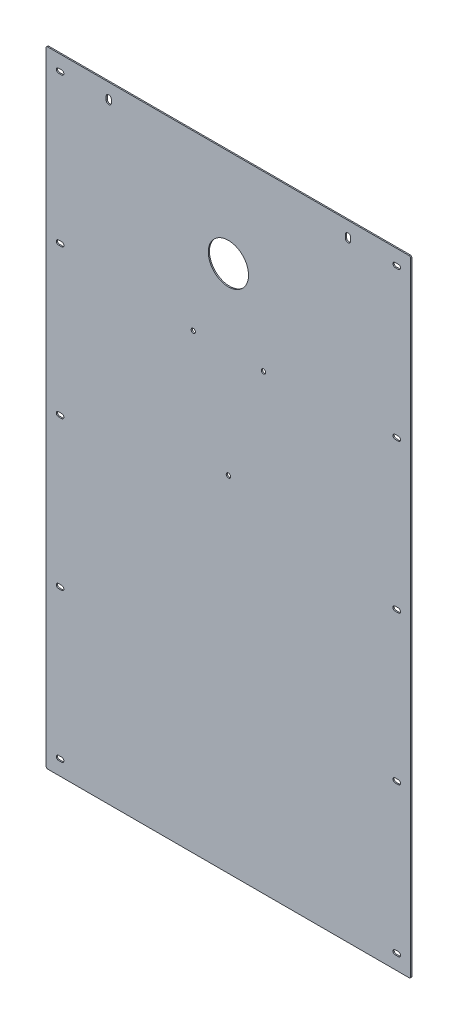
ISO-10303-21;
HEADER;
FILE_DESCRIPTION(('STEP AP214'),'2;1');
FILE_NAME('part.step','',(''),(''),'','','');
FILE_SCHEMA(('AUTOMOTIVE_DESIGN { 1 0 10303 214 1 1 1 1 }'));
ENDSEC;
DATA;
#1=APPLICATION_CONTEXT('core data for automotive mechanical design processes');
#2=APPLICATION_PROTOCOL_DEFINITION('international standard','automotive_design',2000,#1);
#3=PRODUCT_CONTEXT('',#1,'mechanical');
#4=PRODUCT('Part','Part','',(#3));
#5=PRODUCT_RELATED_PRODUCT_CATEGORY('part','',(#4));
#6=PRODUCT_DEFINITION_FORMATION('','',#4);
#7=PRODUCT_DEFINITION_CONTEXT('part definition',#1,'design');
#8=PRODUCT_DEFINITION('design','',#6,#7);
#9=PRODUCT_DEFINITION_SHAPE('','',#8);
#10=(LENGTH_UNIT() NAMED_UNIT(*) SI_UNIT(.MILLI.,.METRE.));
#11=(NAMED_UNIT(*) PLANE_ANGLE_UNIT() SI_UNIT($,.RADIAN.));
#12=(NAMED_UNIT(*) SI_UNIT($,.STERADIAN.) SOLID_ANGLE_UNIT());
#13=UNCERTAINTY_MEASURE_WITH_UNIT(LENGTH_MEASURE(1.E-05),#10,'distance_accuracy_value','');
#14=(GEOMETRIC_REPRESENTATION_CONTEXT(3) GLOBAL_UNCERTAINTY_ASSIGNED_CONTEXT((#13)) GLOBAL_UNIT_ASSIGNED_CONTEXT((#10,
#11,#12)) REPRESENTATION_CONTEXT('',''));
#15=CARTESIAN_POINT('',(0.,0.,0.));
#16=DIRECTION('',(0.,0.,1.));
#17=DIRECTION('',(1.,0.,0.));
#18=AXIS2_PLACEMENT_3D('',#15,#16,#17);
#19=CARTESIAN_POINT('',(0.,0.,1.5));
#20=DIRECTION('',(0.,0.,-1.));
#21=DIRECTION('',(-1.,0.,0.));
#22=AXIS2_PLACEMENT_3D('',#19,#20,#21);
#23=PLANE('',#22);
#24=CARTESIAN_POINT('',(0.,40.,1.5));
#25=DIRECTION('',(0.,0.,1.));
#26=DIRECTION('',(1.,0.,0.));
#27=AXIS2_PLACEMENT_3D('',#24,#25,#26);
#28=CIRCLE('',#27,2.75);
#29=CARTESIAN_POINT('',(2.75,40.,1.5));
#30=VERTEX_POINT('',#29);
#31=EDGE_CURVE('E1582',#30,#30,#28,.T.);
#32=ORIENTED_EDGE('',*,*,#31,.F.);
#33=EDGE_LOOP('',(#32));
#34=FACE_BOUND('',#33,.T.);
#35=CARTESIAN_POINT('',(-44.,175.,1.5));
#36=DIRECTION('',(0.,0.,1.));
#37=DIRECTION('',(1.,0.,0.));
#38=AXIS2_PLACEMENT_3D('',#35,#36,#37);
#39=CIRCLE('',#38,2.75);
#40=CARTESIAN_POINT('',(-41.25,175.,1.5));
#41=VERTEX_POINT('',#40);
#42=EDGE_CURVE('E1584',#41,#41,#39,.T.);
#43=ORIENTED_EDGE('',*,*,#42,.F.);
#44=EDGE_LOOP('',(#43));
#45=FACE_BOUND('',#44,.T.);
#46=DIRECTION('',(0.,1.,0.));
#47=VECTOR('',#46,1.);
#48=CARTESIAN_POINT('',(-146.7,371.,1.5));
#49=LINE('',#48,#47);
#50=CARTESIAN_POINT('',(-146.7,371.,1.5));
#51=VERTEX_POINT('',#50);
#52=CARTESIAN_POINT('',(-146.7,375.,1.5));
#53=VERTEX_POINT('',#52);
#54=EDGE_CURVE('E445',#51,#53,#49,.T.);
#55=ORIENTED_EDGE('',*,*,#54,.F.);
#56=CARTESIAN_POINT('',(-150.,371.,1.5));
#57=DIRECTION('',(0.,0.,1.));
#58=DIRECTION('',(1.,0.,0.));
#59=AXIS2_PLACEMENT_3D('',#56,#57,#58);
#60=CIRCLE('',#59,3.3);
#61=CARTESIAN_POINT('',(-153.3,371.,1.5));
#62=VERTEX_POINT('',#61);
#63=EDGE_CURVE('E57',#62,#51,#60,.T.);
#64=ORIENTED_EDGE('',*,*,#63,.F.);
#65=DIRECTION('',(0.,-1.,0.));
#66=VECTOR('',#65,1.);
#67=CARTESIAN_POINT('',(-153.3,371.,1.5));
#68=LINE('',#67,#66);
#69=CARTESIAN_POINT('',(-153.3,375.,1.5));
#70=VERTEX_POINT('',#69);
#71=EDGE_CURVE('E434',#70,#62,#68,.T.);
#72=ORIENTED_EDGE('',*,*,#71,.F.);
#73=CARTESIAN_POINT('',(-150.,375.,1.5));
#74=DIRECTION('',(0.,0.,1.));
#75=DIRECTION('',(1.,0.,0.));
#76=AXIS2_PLACEMENT_3D('',#73,#74,#75);
#77=CIRCLE('',#76,3.3);
#78=EDGE_CURVE('E447',#53,#70,#77,.T.);
#79=ORIENTED_EDGE('',*,*,#78,.F.);
#80=EDGE_LOOP('',(#55,#64,#72,#79));
#81=FACE_BOUND('',#80,.T.);
#82=CARTESIAN_POINT('',(0.,270.,1.5));
#83=DIRECTION('',(0.,0.,1.));
#84=DIRECTION('',(1.,0.,0.));
#85=AXIS2_PLACEMENT_3D('',#82,#83,#84);
#86=CIRCLE('',#85,25.25);
#87=CARTESIAN_POINT('',(25.25,270.,1.5));
#88=VERTEX_POINT('',#87);
#89=EDGE_CURVE('E453',#88,#88,#86,.T.);
#90=ORIENTED_EDGE('',*,*,#89,.F.);
#91=EDGE_LOOP('',(#90));
#92=FACE_BOUND('',#91,.T.);
#93=DIRECTION('',(1.,0.,0.));
#94=VECTOR('',#93,1.);
#95=CARTESIAN_POINT('',(-213.,370.25,1.5));
#96=LINE('',#95,#94);
#97=CARTESIAN_POINT('',(-213.,370.25,1.5));
#98=VERTEX_POINT('',#97);
#99=CARTESIAN_POINT('',(-209.,370.25,1.5));
#100=VERTEX_POINT('',#99);
#101=EDGE_CURVE('E618',#98,#100,#96,.T.);
#102=ORIENTED_EDGE('',*,*,#101,.F.);
#103=CARTESIAN_POINT('',(-213.,373.,1.5));
#104=DIRECTION('',(0.,0.,1.));
#105=DIRECTION('',(-1.,0.,0.));
#106=AXIS2_PLACEMENT_3D('',#103,#104,#105);
#107=CIRCLE('',#106,2.74999999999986);
#108=CARTESIAN_POINT('',(-213.,375.75,1.5));
#109=VERTEX_POINT('',#108);
#110=EDGE_CURVE('E615',#109,#98,#107,.T.);
#111=ORIENTED_EDGE('',*,*,#110,.F.);
#112=DIRECTION('',(-1.,0.,0.));
#113=VECTOR('',#112,1.);
#114=CARTESIAN_POINT('',(-213.,375.75,1.5));
#115=LINE('',#114,#113);
#116=CARTESIAN_POINT('',(-209.,375.75,1.5));
#117=VERTEX_POINT('',#116);
#118=EDGE_CURVE('E605',#117,#109,#115,.T.);
#119=ORIENTED_EDGE('',*,*,#118,.F.);
#120=CARTESIAN_POINT('',(-209.,373.,1.5));
#121=DIRECTION('',(0.,0.,1.));
#122=DIRECTION('',(-1.,0.,0.));
#123=AXIS2_PLACEMENT_3D('',#120,#121,#122);
#124=CIRCLE('',#123,2.74999999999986);
#125=EDGE_CURVE('E621',#100,#117,#124,.T.);
#126=ORIENTED_EDGE('',*,*,#125,.F.);
#127=EDGE_LOOP('',(#102,#111,#119,#126));
#128=FACE_BOUND('',#127,.T.);
#129=DIRECTION('',(1.,0.,0.));
#130=VECTOR('',#129,1.);
#131=CARTESIAN_POINT('',(-213.,-2.75000000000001,1.5));
#132=LINE('',#131,#130);
#133=CARTESIAN_POINT('',(-213.,-2.75000000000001,1.5));
#134=VERTEX_POINT('',#133);
#135=CARTESIAN_POINT('',(-209.,-2.75000000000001,1.5));
#136=VERTEX_POINT('',#135);
#137=EDGE_CURVE('E684',#134,#136,#132,.T.);
#138=ORIENTED_EDGE('',*,*,#137,.F.);
#139=CARTESIAN_POINT('',(-213.,0.,1.5));
#140=DIRECTION('',(0.,0.,1.));
#141=DIRECTION('',(-1.,0.,0.));
#142=AXIS2_PLACEMENT_3D('',#139,#140,#141);
#143=CIRCLE('',#142,2.75000000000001);
#144=CARTESIAN_POINT('',(-213.,2.75000000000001,1.5));
#145=VERTEX_POINT('',#144);
#146=EDGE_CURVE('E681',#145,#134,#143,.T.);
#147=ORIENTED_EDGE('',*,*,#146,.F.);
#148=DIRECTION('',(-1.,0.,0.));
#149=VECTOR('',#148,1.);
#150=CARTESIAN_POINT('',(-213.,2.75000000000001,1.5));
#151=LINE('',#150,#149);
#152=CARTESIAN_POINT('',(-209.,2.75000000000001,1.5));
#153=VERTEX_POINT('',#152);
#154=EDGE_CURVE('E671',#153,#145,#151,.T.);
#155=ORIENTED_EDGE('',*,*,#154,.F.);
#156=CARTESIAN_POINT('',(-209.,0.,1.5));
#157=DIRECTION('',(0.,0.,1.));
#158=DIRECTION('',(-1.,0.,0.));
#159=AXIS2_PLACEMENT_3D('',#156,#157,#158);
#160=CIRCLE('',#159,2.75000000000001);
#161=EDGE_CURVE('E687',#136,#153,#160,.T.);
#162=ORIENTED_EDGE('',*,*,#161,.F.);
#163=EDGE_LOOP('',(#138,#147,#155,#162));
#164=FACE_BOUND('',#163,.T.);
#165=DIRECTION('',(1.,0.,0.));
#166=VECTOR('',#165,1.);
#167=CARTESIAN_POINT('',(-213.,-375.75,1.5));
#168=LINE('',#167,#166);
#169=CARTESIAN_POINT('',(-213.,-375.75,1.5));
#170=VERTEX_POINT('',#169);
#171=CARTESIAN_POINT('',(-209.,-375.75,1.5));
#172=VERTEX_POINT('',#171);
#173=EDGE_CURVE('E749',#170,#172,#168,.T.);
#174=ORIENTED_EDGE('',*,*,#173,.F.);
#175=CARTESIAN_POINT('',(-213.,-373.,1.5));
#176=DIRECTION('',(0.,0.,1.));
#177=DIRECTION('',(-1.,0.,0.));
#178=AXIS2_PLACEMENT_3D('',#175,#176,#177);
#179=CIRCLE('',#178,2.74999999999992);
#180=CARTESIAN_POINT('',(-213.,-370.25,1.5));
#181=VERTEX_POINT('',#180);
#182=EDGE_CURVE('E464',#181,#170,#179,.T.);
#183=ORIENTED_EDGE('',*,*,#182,.F.);
#184=DIRECTION('',(-1.,0.,0.));
#185=VECTOR('',#184,1.);
#186=CARTESIAN_POINT('',(-213.,-370.25,1.5));
#187=LINE('',#186,#185);
#188=CARTESIAN_POINT('',(-209.,-370.25,1.5));
#189=VERTEX_POINT('',#188);
#190=EDGE_CURVE('E737',#189,#181,#187,.T.);
#191=ORIENTED_EDGE('',*,*,#190,.F.);
#192=CARTESIAN_POINT('',(-209.,-373.,1.5));
#193=DIRECTION('',(0.,0.,1.));
#194=DIRECTION('',(-1.,0.,0.));
#195=AXIS2_PLACEMENT_3D('',#192,#193,#194);
#196=CIRCLE('',#195,2.74999999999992);
#197=EDGE_CURVE('E751',#172,#189,#196,.T.);
#198=ORIENTED_EDGE('',*,*,#197,.F.);
#199=EDGE_LOOP('',(#174,#183,#191,#198));
#200=FACE_BOUND('',#199,.T.);
#201=DIRECTION('',(-1.,0.,0.));
#202=VECTOR('',#201,1.);
#203=CARTESIAN_POINT('',(213.,-370.25,1.5));
#204=LINE('',#203,#202);
#205=CARTESIAN_POINT('',(213.,-370.25,1.5));
#206=VERTEX_POINT('',#205);
#207=CARTESIAN_POINT('',(209.,-370.25,1.5));
#208=VERTEX_POINT('',#207);
#209=EDGE_CURVE('E585',#206,#208,#204,.T.);
#210=ORIENTED_EDGE('',*,*,#209,.F.);
#211=CARTESIAN_POINT('',(213.,-373.,1.5));
#212=DIRECTION('',(0.,0.,1.));
#213=DIRECTION('',(1.,0.,0.));
#214=AXIS2_PLACEMENT_3D('',#211,#212,#213);
#215=CIRCLE('',#214,2.74999999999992);
#216=CARTESIAN_POINT('',(213.,-375.75,1.5));
#217=VERTEX_POINT('',#216);
#218=EDGE_CURVE('E582',#217,#206,#215,.T.);
#219=ORIENTED_EDGE('',*,*,#218,.F.);
#220=DIRECTION('',(1.,0.,0.));
#221=VECTOR('',#220,1.);
#222=CARTESIAN_POINT('',(213.,-375.75,1.5));
#223=LINE('',#222,#221);
#224=CARTESIAN_POINT('',(209.,-375.75,1.5));
#225=VERTEX_POINT('',#224);
#226=EDGE_CURVE('E572',#225,#217,#223,.T.);
#227=ORIENTED_EDGE('',*,*,#226,.F.);
#228=CARTESIAN_POINT('',(209.,-373.,1.5));
#229=DIRECTION('',(0.,0.,1.));
#230=DIRECTION('',(1.,0.,0.));
#231=AXIS2_PLACEMENT_3D('',#228,#229,#230);
#232=CIRCLE('',#231,2.74999999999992);
#233=EDGE_CURVE('E588',#208,#225,#232,.T.);
#234=ORIENTED_EDGE('',*,*,#233,.F.);
#235=EDGE_LOOP('',(#210,#219,#227,#234));
#236=FACE_BOUND('',#235,.T.);
#237=DIRECTION('',(-1.,0.,0.));
#238=VECTOR('',#237,1.);
#239=CARTESIAN_POINT('',(213.,2.75000000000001,1.5));
#240=LINE('',#239,#238);
#241=CARTESIAN_POINT('',(213.,2.75000000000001,1.5));
#242=VERTEX_POINT('',#241);
#243=CARTESIAN_POINT('',(209.,2.75000000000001,1.5));
#244=VERTEX_POINT('',#243);
#245=EDGE_CURVE('E519',#242,#244,#240,.T.);
#246=ORIENTED_EDGE('',*,*,#245,.F.);
#247=CARTESIAN_POINT('',(213.,0.,1.5));
#248=DIRECTION('',(0.,0.,1.));
#249=DIRECTION('',(1.,0.,0.));
#250=AXIS2_PLACEMENT_3D('',#247,#248,#249);
#251=CIRCLE('',#250,2.75000000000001);
#252=CARTESIAN_POINT('',(213.,-2.75000000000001,1.5));
#253=VERTEX_POINT('',#252);
#254=EDGE_CURVE('E516',#253,#242,#251,.T.);
#255=ORIENTED_EDGE('',*,*,#254,.F.);
#256=DIRECTION('',(1.,0.,0.));
#257=VECTOR('',#256,1.);
#258=CARTESIAN_POINT('',(213.,-2.75000000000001,1.5));
#259=LINE('',#258,#257);
#260=CARTESIAN_POINT('',(209.,-2.75000000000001,1.5));
#261=VERTEX_POINT('',#260);
#262=EDGE_CURVE('E506',#261,#253,#259,.T.);
#263=ORIENTED_EDGE('',*,*,#262,.F.);
#264=CARTESIAN_POINT('',(209.,0.,1.5));
#265=DIRECTION('',(0.,0.,1.));
#266=DIRECTION('',(1.,0.,0.));
#267=AXIS2_PLACEMENT_3D('',#264,#265,#266);
#268=CIRCLE('',#267,2.75000000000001);
#269=EDGE_CURVE('E522',#244,#261,#268,.T.);
#270=ORIENTED_EDGE('',*,*,#269,.F.);
#271=EDGE_LOOP('',(#246,#255,#263,#270));
#272=FACE_BOUND('',#271,.T.);
#273=DIRECTION('',(-1.,0.,0.));
#274=VECTOR('',#273,1.);
#275=CARTESIAN_POINT('',(213.,375.75,1.5));
#276=LINE('',#275,#274);
#277=CARTESIAN_POINT('',(213.,375.75,1.5));
#278=VERTEX_POINT('',#277);
#279=CARTESIAN_POINT('',(209.,375.75,1.5));
#280=VERTEX_POINT('',#279);
#281=EDGE_CURVE('E780',#278,#280,#276,.T.);
#282=ORIENTED_EDGE('',*,*,#281,.F.);
#283=CARTESIAN_POINT('',(213.,373.,1.5));
#284=DIRECTION('',(0.,0.,1.));
#285=DIRECTION('',(1.,0.,0.));
#286=AXIS2_PLACEMENT_3D('',#283,#284,#285);
#287=CIRCLE('',#286,2.74999999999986);
#288=CARTESIAN_POINT('',(213.,370.25,1.5));
#289=VERTEX_POINT('',#288);
#290=EDGE_CURVE('E494',#289,#278,#287,.T.);
#291=ORIENTED_EDGE('',*,*,#290,.F.);
#292=DIRECTION('',(1.,0.,0.));
#293=VECTOR('',#292,1.);
#294=CARTESIAN_POINT('',(213.,370.25,1.5));
#295=LINE('',#294,#293);
#296=CARTESIAN_POINT('',(209.,370.25,1.5));
#297=VERTEX_POINT('',#296);
#298=EDGE_CURVE('E768',#297,#289,#295,.T.);
#299=ORIENTED_EDGE('',*,*,#298,.F.);
#300=CARTESIAN_POINT('',(209.,373.,1.5));
#301=DIRECTION('',(0.,0.,1.));
#302=DIRECTION('',(1.,0.,0.));
#303=AXIS2_PLACEMENT_3D('',#300,#301,#302);
#304=CIRCLE('',#303,2.74999999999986);
#305=EDGE_CURVE('E782',#280,#297,#304,.T.);
#306=ORIENTED_EDGE('',*,*,#305,.F.);
#307=EDGE_LOOP('',(#282,#291,#299,#306));
#308=FACE_BOUND('',#307,.T.);
#309=DIRECTION('',(-1.,0.,0.));
#310=VECTOR('',#309,1.);
#311=CARTESIAN_POINT('',(213.,189.25,1.5));
#312=LINE('',#311,#310);
#313=CARTESIAN_POINT('',(213.,189.25,1.5));
#314=VERTEX_POINT('',#313);
#315=CARTESIAN_POINT('',(209.,189.25,1.5));
#316=VERTEX_POINT('',#315);
#317=EDGE_CURVE('E484',#314,#316,#312,.T.);
#318=ORIENTED_EDGE('',*,*,#317,.F.);
#319=CARTESIAN_POINT('',(213.,186.5,1.5));
#320=DIRECTION('',(0.,0.,1.));
#321=DIRECTION('',(1.,0.,0.));
#322=AXIS2_PLACEMENT_3D('',#319,#320,#321);
#323=CIRCLE('',#322,2.74999999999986);
#324=CARTESIAN_POINT('',(213.,183.75,1.5));
#325=VERTEX_POINT('',#324);
#326=EDGE_CURVE('E481',#325,#314,#323,.T.);
#327=ORIENTED_EDGE('',*,*,#326,.F.);
#328=DIRECTION('',(1.,0.,0.));
#329=VECTOR('',#328,1.);
#330=CARTESIAN_POINT('',(213.,183.75,1.5));
#331=LINE('',#330,#329);
#332=CARTESIAN_POINT('',(209.,183.75,1.5));
#333=VERTEX_POINT('',#332);
#334=EDGE_CURVE('E471',#333,#325,#331,.T.);
#335=ORIENTED_EDGE('',*,*,#334,.F.);
#336=CARTESIAN_POINT('',(209.,186.5,1.5));
#337=DIRECTION('',(0.,0.,1.));
#338=DIRECTION('',(1.,0.,0.));
#339=AXIS2_PLACEMENT_3D('',#336,#337,#338);
#340=CIRCLE('',#339,2.74999999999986);
#341=EDGE_CURVE('E487',#316,#333,#340,.T.);
#342=ORIENTED_EDGE('',*,*,#341,.F.);
#343=EDGE_LOOP('',(#318,#327,#335,#342));
#344=FACE_BOUND('',#343,.T.);
#345=DIRECTION('',(-1.,0.,0.));
#346=VECTOR('',#345,1.);
#347=CARTESIAN_POINT('',(213.,-183.75,1.5));
#348=LINE('',#347,#346);
#349=CARTESIAN_POINT('',(213.,-183.75,1.5));
#350=VERTEX_POINT('',#349);
#351=CARTESIAN_POINT('',(209.,-183.75,1.5));
#352=VERTEX_POINT('',#351);
#353=EDGE_CURVE('E552',#350,#352,#348,.T.);
#354=ORIENTED_EDGE('',*,*,#353,.F.);
#355=CARTESIAN_POINT('',(213.,-186.5,1.5));
#356=DIRECTION('',(0.,0.,1.));
#357=DIRECTION('',(1.,0.,0.));
#358=AXIS2_PLACEMENT_3D('',#355,#356,#357);
#359=CIRCLE('',#358,2.74999999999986);
#360=CARTESIAN_POINT('',(213.,-189.25,1.5));
#361=VERTEX_POINT('',#360);
#362=EDGE_CURVE('E549',#361,#350,#359,.T.);
#363=ORIENTED_EDGE('',*,*,#362,.F.);
#364=DIRECTION('',(1.,0.,0.));
#365=VECTOR('',#364,1.);
#366=CARTESIAN_POINT('',(213.,-189.25,1.5));
#367=LINE('',#366,#365);
#368=CARTESIAN_POINT('',(209.,-189.25,1.5));
#369=VERTEX_POINT('',#368);
#370=EDGE_CURVE('E539',#369,#361,#367,.T.);
#371=ORIENTED_EDGE('',*,*,#370,.F.);
#372=CARTESIAN_POINT('',(209.,-186.5,1.5));
#373=DIRECTION('',(0.,0.,1.));
#374=DIRECTION('',(1.,0.,0.));
#375=AXIS2_PLACEMENT_3D('',#372,#373,#374);
#376=CIRCLE('',#375,2.74999999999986);
#377=EDGE_CURVE('E555',#352,#369,#376,.T.);
#378=ORIENTED_EDGE('',*,*,#377,.F.);
#379=EDGE_LOOP('',(#354,#363,#371,#378));
#380=FACE_BOUND('',#379,.T.);
#381=DIRECTION('',(1.,0.,0.));
#382=VECTOR('',#381,1.);
#383=CARTESIAN_POINT('',(-213.,-189.25,1.5));
#384=LINE('',#383,#382);
#385=CARTESIAN_POINT('',(-213.,-189.25,1.5));
#386=VERTEX_POINT('',#385);
#387=CARTESIAN_POINT('',(-209.,-189.25,1.5));
#388=VERTEX_POINT('',#387);
#389=EDGE_CURVE('E717',#386,#388,#384,.T.);
#390=ORIENTED_EDGE('',*,*,#389,.F.);
#391=CARTESIAN_POINT('',(-213.,-186.5,1.5));
#392=DIRECTION('',(0.,0.,1.));
#393=DIRECTION('',(-1.,0.,0.));
#394=AXIS2_PLACEMENT_3D('',#391,#392,#393);
#395=CIRCLE('',#394,2.74999999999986);
#396=CARTESIAN_POINT('',(-213.,-183.75,1.5));
#397=VERTEX_POINT('',#396);
#398=EDGE_CURVE('E714',#397,#386,#395,.T.);
#399=ORIENTED_EDGE('',*,*,#398,.F.);
#400=DIRECTION('',(-1.,0.,0.));
#401=VECTOR('',#400,1.);
#402=CARTESIAN_POINT('',(-213.,-183.75,1.5));
#403=LINE('',#402,#401);
#404=CARTESIAN_POINT('',(-209.,-183.75,1.5));
#405=VERTEX_POINT('',#404);
#406=EDGE_CURVE('E704',#405,#397,#403,.T.);
#407=ORIENTED_EDGE('',*,*,#406,.F.);
#408=CARTESIAN_POINT('',(-209.,-186.5,1.5));
#409=DIRECTION('',(0.,0.,1.));
#410=DIRECTION('',(-1.,0.,0.));
#411=AXIS2_PLACEMENT_3D('',#408,#409,#410);
#412=CIRCLE('',#411,2.74999999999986);
#413=EDGE_CURVE('E720',#388,#405,#412,.T.);
#414=ORIENTED_EDGE('',*,*,#413,.F.);
#415=EDGE_LOOP('',(#390,#399,#407,#414));
#416=FACE_BOUND('',#415,.T.);
#417=DIRECTION('',(1.,0.,0.));
#418=VECTOR('',#417,1.);
#419=CARTESIAN_POINT('',(-213.,183.75,1.5));
#420=LINE('',#419,#418);
#421=CARTESIAN_POINT('',(-213.,183.75,1.5));
#422=VERTEX_POINT('',#421);
#423=CARTESIAN_POINT('',(-209.,183.75,1.5));
#424=VERTEX_POINT('',#423);
#425=EDGE_CURVE('E651',#422,#424,#420,.T.);
#426=ORIENTED_EDGE('',*,*,#425,.F.);
#427=CARTESIAN_POINT('',(-213.,186.5,1.5));
#428=DIRECTION('',(0.,0.,1.));
#429=DIRECTION('',(-1.,0.,0.));
#430=AXIS2_PLACEMENT_3D('',#427,#428,#429);
#431=CIRCLE('',#430,2.74999999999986);
#432=CARTESIAN_POINT('',(-213.,189.25,1.5));
#433=VERTEX_POINT('',#432);
#434=EDGE_CURVE('E648',#433,#422,#431,.T.);
#435=ORIENTED_EDGE('',*,*,#434,.F.);
#436=DIRECTION('',(-1.,0.,0.));
#437=VECTOR('',#436,1.);
#438=CARTESIAN_POINT('',(-213.,189.25,1.5));
#439=LINE('',#438,#437);
#440=CARTESIAN_POINT('',(-209.,189.25,1.5));
#441=VERTEX_POINT('',#440);
#442=EDGE_CURVE('E638',#441,#433,#439,.T.);
#443=ORIENTED_EDGE('',*,*,#442,.F.);
#444=CARTESIAN_POINT('',(-209.,186.5,1.5));
#445=DIRECTION('',(0.,0.,1.));
#446=DIRECTION('',(-1.,0.,0.));
#447=AXIS2_PLACEMENT_3D('',#444,#445,#446);
#448=CIRCLE('',#447,2.74999999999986);
#449=EDGE_CURVE('E654',#424,#441,#448,.T.);
#450=ORIENTED_EDGE('',*,*,#449,.F.);
#451=EDGE_LOOP('',(#426,#435,#443,#450));
#452=FACE_BOUND('',#451,.T.);
#453=DIRECTION('',(1.,0.,0.));
#454=VECTOR('',#453,1.);
#455=CARTESIAN_POINT('',(-228.5,-392.,1.5));
#456=LINE('',#455,#454);
#457=CARTESIAN_POINT('',(-226.5,-392.,1.5));
#458=VERTEX_POINT('',#457);
#459=CARTESIAN_POINT('',(226.5,-392.,1.5));
#460=VERTEX_POINT('',#459);
#461=EDGE_CURVE('E807',#458,#460,#456,.T.);
#462=ORIENTED_EDGE('',*,*,#461,.T.);
#463=CARTESIAN_POINT('',(226.5,-390.,1.5));
#464=DIRECTION('',(0.,0.,-1.));
#465=DIRECTION('',(-1.,0.,0.));
#466=AXIS2_PLACEMENT_3D('',#463,#464,#465);
#467=CIRCLE('',#466,2.);
#468=CARTESIAN_POINT('',(228.5,-390.,1.5));
#469=VERTEX_POINT('',#468);
#470=EDGE_CURVE('E844',#460,#469,#467,.F.);
#471=ORIENTED_EDGE('',*,*,#470,.T.);
#472=DIRECTION('',(0.,1.,0.));
#473=VECTOR('',#472,1.);
#474=CARTESIAN_POINT('',(228.5,-392.,1.5));
#475=LINE('',#474,#473);
#476=CARTESIAN_POINT('',(228.5,390.,1.5));
#477=VERTEX_POINT('',#476);
#478=EDGE_CURVE('E797',#469,#477,#475,.T.);
#479=ORIENTED_EDGE('',*,*,#478,.T.);
#480=CARTESIAN_POINT('',(226.5,390.,1.5));
#481=DIRECTION('',(0.,0.,-1.));
#482=DIRECTION('',(-1.,0.,0.));
#483=AXIS2_PLACEMENT_3D('',#480,#481,#482);
#484=CIRCLE('',#483,2.);
#485=CARTESIAN_POINT('',(226.5,392.,1.5));
#486=VERTEX_POINT('',#485);
#487=EDGE_CURVE('E838',#477,#486,#484,.F.);
#488=ORIENTED_EDGE('',*,*,#487,.T.);
#489=DIRECTION('',(-1.,0.,0.));
#490=VECTOR('',#489,1.);
#491=CARTESIAN_POINT('',(-228.5,392.,1.5));
#492=LINE('',#491,#490);
#493=CARTESIAN_POINT('',(-226.5,392.,1.5));
#494=VERTEX_POINT('',#493);
#495=EDGE_CURVE('E800',#486,#494,#492,.T.);
#496=ORIENTED_EDGE('',*,*,#495,.T.);
#497=CARTESIAN_POINT('',(-226.5,390.,1.5));
#498=DIRECTION('',(0.,0.,-1.));
#499=DIRECTION('',(-1.,0.,0.));
#500=AXIS2_PLACEMENT_3D('',#497,#498,#499);
#501=CIRCLE('',#500,2.);
#502=CARTESIAN_POINT('',(-228.5,390.,1.5));
#503=VERTEX_POINT('',#502);
#504=EDGE_CURVE('E840',#494,#503,#501,.F.);
#505=ORIENTED_EDGE('',*,*,#504,.T.);
#506=DIRECTION('',(0.,-1.,0.));
#507=VECTOR('',#506,1.);
#508=CARTESIAN_POINT('',(-228.5,-392.,1.5));
#509=LINE('',#508,#507);
#510=CARTESIAN_POINT('',(-228.5,-390.,1.5));
#511=VERTEX_POINT('',#510);
#512=EDGE_CURVE('E804',#503,#511,#509,.T.);
#513=ORIENTED_EDGE('',*,*,#512,.T.);
#514=CARTESIAN_POINT('',(-226.5,-390.,1.5));
#515=DIRECTION('',(0.,0.,-1.));
#516=DIRECTION('',(-1.,0.,0.));
#517=AXIS2_PLACEMENT_3D('',#514,#515,#516);
#518=CIRCLE('',#517,2.);
#519=EDGE_CURVE('E842',#511,#458,#518,.F.);
#520=ORIENTED_EDGE('',*,*,#519,.T.);
#521=EDGE_LOOP('',(#462,#471,#479,#488,#496,#505,#513,#520));
#522=FACE_BOUND('',#521,.T.);
#523=DIRECTION('',(0.,1.,0.));
#524=VECTOR('',#523,1.);
#525=CARTESIAN_POINT('',(153.3,371.,1.5));
#526=LINE('',#525,#524);
#527=CARTESIAN_POINT('',(153.3,371.,1.5));
#528=VERTEX_POINT('',#527);
#529=CARTESIAN_POINT('',(153.3,375.,1.5));
#530=VERTEX_POINT('',#529);
#531=EDGE_CURVE('E420',#528,#530,#526,.T.);
#532=ORIENTED_EDGE('',*,*,#531,.F.);
#533=CARTESIAN_POINT('',(150.,371.,1.5));
#534=DIRECTION('',(0.,0.,1.));
#535=DIRECTION('',(1.,0.,0.));
#536=AXIS2_PLACEMENT_3D('',#533,#534,#535);
#537=CIRCLE('',#536,3.29999999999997);
#538=CARTESIAN_POINT('',(146.7,371.,1.5));
#539=VERTEX_POINT('',#538);
#540=EDGE_CURVE('E49',#539,#528,#537,.T.);
#541=ORIENTED_EDGE('',*,*,#540,.F.);
#542=DIRECTION('',(0.,-1.,0.));
#543=VECTOR('',#542,1.);
#544=CARTESIAN_POINT('',(146.7,371.,1.5));
#545=LINE('',#544,#543);
#546=CARTESIAN_POINT('',(146.7,375.,1.5));
#547=VERTEX_POINT('',#546);
#548=EDGE_CURVE('E409',#547,#539,#545,.T.);
#549=ORIENTED_EDGE('',*,*,#548,.F.);
#550=CARTESIAN_POINT('',(150.,375.,1.5));
#551=DIRECTION('',(0.,0.,1.));
#552=DIRECTION('',(1.,0.,0.));
#553=AXIS2_PLACEMENT_3D('',#550,#551,#552);
#554=CIRCLE('',#553,3.29999999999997);
#555=EDGE_CURVE('E411',#530,#547,#554,.T.);
#556=ORIENTED_EDGE('',*,*,#555,.F.);
#557=EDGE_LOOP('',(#532,#541,#549,#556));
#558=FACE_BOUND('',#557,.T.);
#559=CARTESIAN_POINT('',(44.,175.,1.5));
#560=DIRECTION('',(0.,0.,1.));
#561=DIRECTION('',(1.,0.,0.));
#562=AXIS2_PLACEMENT_3D('',#559,#560,#561);
#563=CIRCLE('',#562,2.75);
#564=CARTESIAN_POINT('',(46.75,175.,1.5));
#565=VERTEX_POINT('',#564);
#566=EDGE_CURVE('E1591',#565,#565,#563,.T.);
#567=ORIENTED_EDGE('',*,*,#566,.F.);
#568=EDGE_LOOP('',(#567));
#569=FACE_BOUND('',#568,.T.);
#570=ADVANCED_FACE('F34',(#34,#45,#81,#92,#128,#164,#200,#236,#272,#308,#344,#380,#416,#452,
#522,#558,#569),#23,.F.);
#571=CARTESIAN_POINT('',(0.,0.,0.));
#572=DIRECTION('',(0.,0.,-1.));
#573=DIRECTION('',(-1.,0.,0.));
#574=AXIS2_PLACEMENT_3D('',#571,#572,#573);
#575=PLANE('',#574);
#576=CARTESIAN_POINT('',(0.,40.,0.));
#577=DIRECTION('',(0.,0.,1.));
#578=DIRECTION('',(1.,0.,0.));
#579=AXIS2_PLACEMENT_3D('',#576,#577,#578);
#580=CIRCLE('',#579,2.75);
#581=CARTESIAN_POINT('',(2.75,40.,0.));
#582=VERTEX_POINT('',#581);
#583=EDGE_CURVE('E1580',#582,#582,#580,.T.);
#584=ORIENTED_EDGE('',*,*,#583,.T.);
#585=EDGE_LOOP('',(#584));
#586=FACE_BOUND('',#585,.T.);
#587=CARTESIAN_POINT('',(-44.,175.,0.));
#588=DIRECTION('',(0.,0.,1.));
#589=DIRECTION('',(1.,0.,0.));
#590=AXIS2_PLACEMENT_3D('',#587,#588,#589);
#591=CIRCLE('',#590,2.75);
#592=CARTESIAN_POINT('',(-41.25,175.,0.));
#593=VERTEX_POINT('',#592);
#594=EDGE_CURVE('E1589',#593,#593,#591,.T.);
#595=ORIENTED_EDGE('',*,*,#594,.T.);
#596=EDGE_LOOP('',(#595));
#597=FACE_BOUND('',#596,.T.);
#598=CARTESIAN_POINT('',(0.,270.,0.));
#599=DIRECTION('',(0.,0.,1.));
#600=DIRECTION('',(1.,0.,0.));
#601=AXIS2_PLACEMENT_3D('',#598,#599,#600);
#602=CIRCLE('',#601,25.25);
#603=CARTESIAN_POINT('',(25.25,270.,0.));
#604=VERTEX_POINT('',#603);
#605=EDGE_CURVE('E461',#604,#604,#602,.T.);
#606=ORIENTED_EDGE('',*,*,#605,.T.);
#607=EDGE_LOOP('',(#606));
#608=FACE_BOUND('',#607,.T.);
#609=CARTESIAN_POINT('',(213.,186.5,0.));
#610=DIRECTION('',(0.,0.,1.));
#611=DIRECTION('',(1.,0.,0.));
#612=AXIS2_PLACEMENT_3D('',#609,#610,#611);
#613=CIRCLE('',#612,2.74999999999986);
#614=CARTESIAN_POINT('',(213.,183.75,0.));
#615=VERTEX_POINT('',#614);
#616=CARTESIAN_POINT('',(213.,189.25,0.));
#617=VERTEX_POINT('',#616);
#618=EDGE_CURVE('E467',#615,#617,#613,.T.);
#619=ORIENTED_EDGE('',*,*,#618,.T.);
#620=DIRECTION('',(-1.,0.,0.));
#621=VECTOR('',#620,1.);
#622=CARTESIAN_POINT('',(213.,189.25,0.));
#623=LINE('',#622,#621);
#624=CARTESIAN_POINT('',(209.,189.25,0.));
#625=VERTEX_POINT('',#624);
#626=EDGE_CURVE('E470',#617,#625,#623,.T.);
#627=ORIENTED_EDGE('',*,*,#626,.T.);
#628=CARTESIAN_POINT('',(209.,186.5,0.));
#629=DIRECTION('',(0.,0.,1.));
#630=DIRECTION('',(1.,0.,0.));
#631=AXIS2_PLACEMENT_3D('',#628,#629,#630);
#632=CIRCLE('',#631,2.74999999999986);
#633=CARTESIAN_POINT('',(209.,183.75,0.));
#634=VERTEX_POINT('',#633);
#635=EDGE_CURVE('E474',#625,#634,#632,.T.);
#636=ORIENTED_EDGE('',*,*,#635,.T.);
#637=DIRECTION('',(1.,0.,0.));
#638=VECTOR('',#637,1.);
#639=CARTESIAN_POINT('',(213.,183.75,0.));
#640=LINE('',#639,#638);
#641=EDGE_CURVE('E477',#634,#615,#640,.T.);
#642=ORIENTED_EDGE('',*,*,#641,.T.);
#643=EDGE_LOOP('',(#619,#627,#636,#642));
#644=FACE_BOUND('',#643,.T.);
#645=CARTESIAN_POINT('',(213.,0.,0.));
#646=DIRECTION('',(0.,0.,1.));
#647=DIRECTION('',(1.,0.,0.));
#648=AXIS2_PLACEMENT_3D('',#645,#646,#647);
#649=CIRCLE('',#648,2.75000000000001);
#650=CARTESIAN_POINT('',(213.,-2.75000000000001,0.));
#651=VERTEX_POINT('',#650);
#652=CARTESIAN_POINT('',(213.,2.75000000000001,0.));
#653=VERTEX_POINT('',#652);
#654=EDGE_CURVE('E502',#651,#653,#649,.T.);
#655=ORIENTED_EDGE('',*,*,#654,.T.);
#656=DIRECTION('',(-1.,0.,0.));
#657=VECTOR('',#656,1.);
#658=CARTESIAN_POINT('',(213.,2.75000000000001,0.));
#659=LINE('',#658,#657);
#660=CARTESIAN_POINT('',(209.,2.75000000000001,0.));
#661=VERTEX_POINT('',#660);
#662=EDGE_CURVE('E505',#653,#661,#659,.T.);
#663=ORIENTED_EDGE('',*,*,#662,.T.);
#664=CARTESIAN_POINT('',(209.,0.,0.));
#665=DIRECTION('',(0.,0.,1.));
#666=DIRECTION('',(1.,0.,0.));
#667=AXIS2_PLACEMENT_3D('',#664,#665,#666);
#668=CIRCLE('',#667,2.75000000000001);
#669=CARTESIAN_POINT('',(209.,-2.75000000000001,0.));
#670=VERTEX_POINT('',#669);
#671=EDGE_CURVE('E509',#661,#670,#668,.T.);
#672=ORIENTED_EDGE('',*,*,#671,.T.);
#673=DIRECTION('',(1.,0.,0.));
#674=VECTOR('',#673,1.);
#675=CARTESIAN_POINT('',(213.,-2.75000000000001,0.));
#676=LINE('',#675,#674);
#677=EDGE_CURVE('E512',#670,#651,#676,.T.);
#678=ORIENTED_EDGE('',*,*,#677,.T.);
#679=EDGE_LOOP('',(#655,#663,#672,#678));
#680=FACE_BOUND('',#679,.T.);
#681=CARTESIAN_POINT('',(213.,-186.5,0.));
#682=DIRECTION('',(0.,0.,1.));
#683=DIRECTION('',(1.,0.,0.));
#684=AXIS2_PLACEMENT_3D('',#681,#682,#683);
#685=CIRCLE('',#684,2.74999999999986);
#686=CARTESIAN_POINT('',(213.,-189.25,0.));
#687=VERTEX_POINT('',#686);
#688=CARTESIAN_POINT('',(213.,-183.75,0.));
#689=VERTEX_POINT('',#688);
#690=EDGE_CURVE('E535',#687,#689,#685,.T.);
#691=ORIENTED_EDGE('',*,*,#690,.T.);
#692=DIRECTION('',(-1.,0.,0.));
#693=VECTOR('',#692,1.);
#694=CARTESIAN_POINT('',(213.,-183.75,0.));
#695=LINE('',#694,#693);
#696=CARTESIAN_POINT('',(209.,-183.75,0.));
#697=VERTEX_POINT('',#696);
#698=EDGE_CURVE('E538',#689,#697,#695,.T.);
#699=ORIENTED_EDGE('',*,*,#698,.T.);
#700=CARTESIAN_POINT('',(209.,-186.5,0.));
#701=DIRECTION('',(0.,0.,1.));
#702=DIRECTION('',(1.,0.,0.));
#703=AXIS2_PLACEMENT_3D('',#700,#701,#702);
#704=CIRCLE('',#703,2.74999999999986);
#705=CARTESIAN_POINT('',(209.,-189.25,0.));
#706=VERTEX_POINT('',#705);
#707=EDGE_CURVE('E542',#697,#706,#704,.T.);
#708=ORIENTED_EDGE('',*,*,#707,.T.);
#709=DIRECTION('',(1.,0.,0.));
#710=VECTOR('',#709,1.);
#711=CARTESIAN_POINT('',(213.,-189.25,0.));
#712=LINE('',#711,#710);
#713=EDGE_CURVE('E545',#706,#687,#712,.T.);
#714=ORIENTED_EDGE('',*,*,#713,.T.);
#715=EDGE_LOOP('',(#691,#699,#708,#714));
#716=FACE_BOUND('',#715,.T.);
#717=CARTESIAN_POINT('',(213.,-373.,0.));
#718=DIRECTION('',(0.,0.,1.));
#719=DIRECTION('',(1.,0.,0.));
#720=AXIS2_PLACEMENT_3D('',#717,#718,#719);
#721=CIRCLE('',#720,2.74999999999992);
#722=CARTESIAN_POINT('',(213.,-375.75,0.));
#723=VERTEX_POINT('',#722);
#724=CARTESIAN_POINT('',(213.,-370.25,0.));
#725=VERTEX_POINT('',#724);
#726=EDGE_CURVE('E568',#723,#725,#721,.T.);
#727=ORIENTED_EDGE('',*,*,#726,.T.);
#728=DIRECTION('',(-1.,0.,0.));
#729=VECTOR('',#728,1.);
#730=CARTESIAN_POINT('',(213.,-370.25,0.));
#731=LINE('',#730,#729);
#732=CARTESIAN_POINT('',(209.,-370.25,0.));
#733=VERTEX_POINT('',#732);
#734=EDGE_CURVE('E571',#725,#733,#731,.T.);
#735=ORIENTED_EDGE('',*,*,#734,.T.);
#736=CARTESIAN_POINT('',(209.,-373.,0.));
#737=DIRECTION('',(0.,0.,1.));
#738=DIRECTION('',(1.,0.,0.));
#739=AXIS2_PLACEMENT_3D('',#736,#737,#738);
#740=CIRCLE('',#739,2.74999999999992);
#741=CARTESIAN_POINT('',(209.,-375.75,0.));
#742=VERTEX_POINT('',#741);
#743=EDGE_CURVE('E575',#733,#742,#740,.T.);
#744=ORIENTED_EDGE('',*,*,#743,.T.);
#745=DIRECTION('',(1.,0.,0.));
#746=VECTOR('',#745,1.);
#747=CARTESIAN_POINT('',(213.,-375.75,0.));
#748=LINE('',#747,#746);
#749=EDGE_CURVE('E578',#742,#723,#748,.T.);
#750=ORIENTED_EDGE('',*,*,#749,.T.);
#751=EDGE_LOOP('',(#727,#735,#744,#750));
#752=FACE_BOUND('',#751,.T.);
#753=CARTESIAN_POINT('',(-213.,373.,0.));
#754=DIRECTION('',(0.,0.,1.));
#755=DIRECTION('',(-1.,0.,0.));
#756=AXIS2_PLACEMENT_3D('',#753,#754,#755);
#757=CIRCLE('',#756,2.74999999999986);
#758=CARTESIAN_POINT('',(-213.,375.75,0.));
#759=VERTEX_POINT('',#758);
#760=CARTESIAN_POINT('',(-213.,370.25,0.));
#761=VERTEX_POINT('',#760);
#762=EDGE_CURVE('E601',#759,#761,#757,.T.);
#763=ORIENTED_EDGE('',*,*,#762,.T.);
#764=DIRECTION('',(1.,0.,0.));
#765=VECTOR('',#764,1.);
#766=CARTESIAN_POINT('',(-213.,370.25,0.));
#767=LINE('',#766,#765);
#768=CARTESIAN_POINT('',(-209.,370.25,0.));
#769=VERTEX_POINT('',#768);
#770=EDGE_CURVE('E604',#761,#769,#767,.T.);
#771=ORIENTED_EDGE('',*,*,#770,.T.);
#772=CARTESIAN_POINT('',(-209.,373.,0.));
#773=DIRECTION('',(0.,0.,1.));
#774=DIRECTION('',(-1.,0.,0.));
#775=AXIS2_PLACEMENT_3D('',#772,#773,#774);
#776=CIRCLE('',#775,2.74999999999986);
#777=CARTESIAN_POINT('',(-209.,375.75,0.));
#778=VERTEX_POINT('',#777);
#779=EDGE_CURVE('E608',#769,#778,#776,.T.);
#780=ORIENTED_EDGE('',*,*,#779,.T.);
#781=DIRECTION('',(-1.,0.,0.));
#782=VECTOR('',#781,1.);
#783=CARTESIAN_POINT('',(-213.,375.75,0.));
#784=LINE('',#783,#782);
#785=EDGE_CURVE('E611',#778,#759,#784,.T.);
#786=ORIENTED_EDGE('',*,*,#785,.T.);
#787=EDGE_LOOP('',(#763,#771,#780,#786));
#788=FACE_BOUND('',#787,.T.);
#789=CARTESIAN_POINT('',(-213.,186.5,0.));
#790=DIRECTION('',(0.,0.,1.));
#791=DIRECTION('',(-1.,0.,0.));
#792=AXIS2_PLACEMENT_3D('',#789,#790,#791);
#793=CIRCLE('',#792,2.74999999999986);
#794=CARTESIAN_POINT('',(-213.,189.25,0.));
#795=VERTEX_POINT('',#794);
#796=CARTESIAN_POINT('',(-213.,183.75,0.));
#797=VERTEX_POINT('',#796);
#798=EDGE_CURVE('E634',#795,#797,#793,.T.);
#799=ORIENTED_EDGE('',*,*,#798,.T.);
#800=DIRECTION('',(1.,0.,0.));
#801=VECTOR('',#800,1.);
#802=CARTESIAN_POINT('',(-213.,183.75,0.));
#803=LINE('',#802,#801);
#804=CARTESIAN_POINT('',(-209.,183.75,0.));
#805=VERTEX_POINT('',#804);
#806=EDGE_CURVE('E637',#797,#805,#803,.T.);
#807=ORIENTED_EDGE('',*,*,#806,.T.);
#808=CARTESIAN_POINT('',(-209.,186.5,0.));
#809=DIRECTION('',(0.,0.,1.));
#810=DIRECTION('',(-1.,0.,0.));
#811=AXIS2_PLACEMENT_3D('',#808,#809,#810);
#812=CIRCLE('',#811,2.74999999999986);
#813=CARTESIAN_POINT('',(-209.,189.25,0.));
#814=VERTEX_POINT('',#813);
#815=EDGE_CURVE('E641',#805,#814,#812,.T.);
#816=ORIENTED_EDGE('',*,*,#815,.T.);
#817=DIRECTION('',(-1.,0.,0.));
#818=VECTOR('',#817,1.);
#819=CARTESIAN_POINT('',(-213.,189.25,0.));
#820=LINE('',#819,#818);
#821=EDGE_CURVE('E644',#814,#795,#820,.T.);
#822=ORIENTED_EDGE('',*,*,#821,.T.);
#823=EDGE_LOOP('',(#799,#807,#816,#822));
#824=FACE_BOUND('',#823,.T.);
#825=CARTESIAN_POINT('',(-213.,0.,0.));
#826=DIRECTION('',(0.,0.,1.));
#827=DIRECTION('',(-1.,0.,0.));
#828=AXIS2_PLACEMENT_3D('',#825,#826,#827);
#829=CIRCLE('',#828,2.75000000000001);
#830=CARTESIAN_POINT('',(-213.,2.75000000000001,0.));
#831=VERTEX_POINT('',#830);
#832=CARTESIAN_POINT('',(-213.,-2.75000000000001,0.));
#833=VERTEX_POINT('',#832);
#834=EDGE_CURVE('E667',#831,#833,#829,.T.);
#835=ORIENTED_EDGE('',*,*,#834,.T.);
#836=DIRECTION('',(1.,0.,0.));
#837=VECTOR('',#836,1.);
#838=CARTESIAN_POINT('',(-213.,-2.75000000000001,0.));
#839=LINE('',#838,#837);
#840=CARTESIAN_POINT('',(-209.,-2.75000000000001,0.));
#841=VERTEX_POINT('',#840);
#842=EDGE_CURVE('E670',#833,#841,#839,.T.);
#843=ORIENTED_EDGE('',*,*,#842,.T.);
#844=CARTESIAN_POINT('',(-209.,0.,0.));
#845=DIRECTION('',(0.,0.,1.));
#846=DIRECTION('',(-1.,0.,0.));
#847=AXIS2_PLACEMENT_3D('',#844,#845,#846);
#848=CIRCLE('',#847,2.75000000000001);
#849=CARTESIAN_POINT('',(-209.,2.75000000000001,0.));
#850=VERTEX_POINT('',#849);
#851=EDGE_CURVE('E674',#841,#850,#848,.T.);
#852=ORIENTED_EDGE('',*,*,#851,.T.);
#853=DIRECTION('',(-1.,0.,0.));
#854=VECTOR('',#853,1.);
#855=CARTESIAN_POINT('',(-213.,2.75000000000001,0.));
#856=LINE('',#855,#854);
#857=EDGE_CURVE('E677',#850,#831,#856,.T.);
#858=ORIENTED_EDGE('',*,*,#857,.T.);
#859=EDGE_LOOP('',(#835,#843,#852,#858));
#860=FACE_BOUND('',#859,.T.);
#861=CARTESIAN_POINT('',(-213.,-186.5,0.));
#862=DIRECTION('',(0.,0.,1.));
#863=DIRECTION('',(-1.,0.,0.));
#864=AXIS2_PLACEMENT_3D('',#861,#862,#863);
#865=CIRCLE('',#864,2.74999999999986);
#866=CARTESIAN_POINT('',(-213.,-183.75,0.));
#867=VERTEX_POINT('',#866);
#868=CARTESIAN_POINT('',(-213.,-189.25,0.));
#869=VERTEX_POINT('',#868);
#870=EDGE_CURVE('E700',#867,#869,#865,.T.);
#871=ORIENTED_EDGE('',*,*,#870,.T.);
#872=DIRECTION('',(1.,0.,0.));
#873=VECTOR('',#872,1.);
#874=CARTESIAN_POINT('',(-213.,-189.25,0.));
#875=LINE('',#874,#873);
#876=CARTESIAN_POINT('',(-209.,-189.25,0.));
#877=VERTEX_POINT('',#876);
#878=EDGE_CURVE('E703',#869,#877,#875,.T.);
#879=ORIENTED_EDGE('',*,*,#878,.T.);
#880=CARTESIAN_POINT('',(-209.,-186.5,0.));
#881=DIRECTION('',(0.,0.,1.));
#882=DIRECTION('',(-1.,0.,0.));
#883=AXIS2_PLACEMENT_3D('',#880,#881,#882);
#884=CIRCLE('',#883,2.74999999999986);
#885=CARTESIAN_POINT('',(-209.,-183.75,0.));
#886=VERTEX_POINT('',#885);
#887=EDGE_CURVE('E707',#877,#886,#884,.T.);
#888=ORIENTED_EDGE('',*,*,#887,.T.);
#889=DIRECTION('',(-1.,0.,0.));
#890=VECTOR('',#889,1.);
#891=CARTESIAN_POINT('',(-213.,-183.75,0.));
#892=LINE('',#891,#890);
#893=EDGE_CURVE('E710',#886,#867,#892,.T.);
#894=ORIENTED_EDGE('',*,*,#893,.T.);
#895=EDGE_LOOP('',(#871,#879,#888,#894));
#896=FACE_BOUND('',#895,.T.);
#897=CARTESIAN_POINT('',(-213.,-373.,0.));
#898=DIRECTION('',(0.,0.,1.));
#899=DIRECTION('',(-1.,0.,0.));
#900=AXIS2_PLACEMENT_3D('',#897,#898,#899);
#901=CIRCLE('',#900,2.74999999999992);
#902=CARTESIAN_POINT('',(-213.,-370.25,0.));
#903=VERTEX_POINT('',#902);
#904=CARTESIAN_POINT('',(-213.,-375.75,0.));
#905=VERTEX_POINT('',#904);
#906=EDGE_CURVE('E733',#903,#905,#901,.T.);
#907=ORIENTED_EDGE('',*,*,#906,.T.);
#908=DIRECTION('',(1.,0.,0.));
#909=VECTOR('',#908,1.);
#910=CARTESIAN_POINT('',(-213.,-375.75,0.));
#911=LINE('',#910,#909);
#912=CARTESIAN_POINT('',(-209.,-375.75,0.));
#913=VERTEX_POINT('',#912);
#914=EDGE_CURVE('E736',#905,#913,#911,.T.);
#915=ORIENTED_EDGE('',*,*,#914,.T.);
#916=CARTESIAN_POINT('',(-209.,-373.,0.));
#917=DIRECTION('',(0.,0.,1.));
#918=DIRECTION('',(-1.,0.,0.));
#919=AXIS2_PLACEMENT_3D('',#916,#917,#918);
#920=CIRCLE('',#919,2.74999999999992);
#921=CARTESIAN_POINT('',(-209.,-370.25,0.));
#922=VERTEX_POINT('',#921);
#923=EDGE_CURVE('E740',#913,#922,#920,.T.);
#924=ORIENTED_EDGE('',*,*,#923,.T.);
#925=DIRECTION('',(-1.,0.,0.));
#926=VECTOR('',#925,1.);
#927=CARTESIAN_POINT('',(-213.,-370.25,0.));
#928=LINE('',#927,#926);
#929=EDGE_CURVE('E743',#922,#903,#928,.T.);
#930=ORIENTED_EDGE('',*,*,#929,.T.);
#931=EDGE_LOOP('',(#907,#915,#924,#930));
#932=FACE_BOUND('',#931,.T.);
#933=CARTESIAN_POINT('',(213.,373.,0.));
#934=DIRECTION('',(0.,0.,1.));
#935=DIRECTION('',(1.,0.,0.));
#936=AXIS2_PLACEMENT_3D('',#933,#934,#935);
#937=CIRCLE('',#936,2.74999999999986);
#938=CARTESIAN_POINT('',(213.,370.25,0.));
#939=VERTEX_POINT('',#938);
#940=CARTESIAN_POINT('',(213.,375.75,0.));
#941=VERTEX_POINT('',#940);
#942=EDGE_CURVE('E764',#939,#941,#937,.T.);
#943=ORIENTED_EDGE('',*,*,#942,.T.);
#944=DIRECTION('',(-1.,0.,0.));
#945=VECTOR('',#944,1.);
#946=CARTESIAN_POINT('',(213.,375.75,0.));
#947=LINE('',#946,#945);
#948=CARTESIAN_POINT('',(209.,375.75,0.));
#949=VERTEX_POINT('',#948);
#950=EDGE_CURVE('E767',#941,#949,#947,.T.);
#951=ORIENTED_EDGE('',*,*,#950,.T.);
#952=CARTESIAN_POINT('',(209.,373.,0.));
#953=DIRECTION('',(0.,0.,1.));
#954=DIRECTION('',(1.,0.,0.));
#955=AXIS2_PLACEMENT_3D('',#952,#953,#954);
#956=CIRCLE('',#955,2.74999999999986);
#957=CARTESIAN_POINT('',(209.,370.25,0.));
#958=VERTEX_POINT('',#957);
#959=EDGE_CURVE('E771',#949,#958,#956,.T.);
#960=ORIENTED_EDGE('',*,*,#959,.T.);
#961=DIRECTION('',(1.,0.,0.));
#962=VECTOR('',#961,1.);
#963=CARTESIAN_POINT('',(213.,370.25,0.));
#964=LINE('',#963,#962);
#965=EDGE_CURVE('E774',#958,#939,#964,.T.);
#966=ORIENTED_EDGE('',*,*,#965,.T.);
#967=EDGE_LOOP('',(#943,#951,#960,#966));
#968=FACE_BOUND('',#967,.T.);
#969=DIRECTION('',(0.,1.,0.));
#970=VECTOR('',#969,1.);
#971=CARTESIAN_POINT('',(228.5,-392.,0.));
#972=LINE('',#971,#970);
#973=CARTESIAN_POINT('',(228.5,-390.,0.));
#974=VERTEX_POINT('',#973);
#975=CARTESIAN_POINT('',(228.5,390.,0.));
#976=VERTEX_POINT('',#975);
#977=EDGE_CURVE('E789',#974,#976,#972,.T.);
#978=ORIENTED_EDGE('',*,*,#977,.F.);
#979=CARTESIAN_POINT('',(226.5,-390.,0.));
#980=DIRECTION('',(0.,0.,-1.));
#981=DIRECTION('',(-1.,0.,0.));
#982=AXIS2_PLACEMENT_3D('',#979,#980,#981);
#983=CIRCLE('',#982,2.);
#984=CARTESIAN_POINT('',(226.5,-392.,0.));
#985=VERTEX_POINT('',#984);
#986=EDGE_CURVE('E831',#974,#985,#983,.T.);
#987=ORIENTED_EDGE('',*,*,#986,.T.);
#988=DIRECTION('',(1.,0.,0.));
#989=VECTOR('',#988,1.);
#990=CARTESIAN_POINT('',(-228.5,-392.,0.));
#991=LINE('',#990,#989);
#992=CARTESIAN_POINT('',(-226.5,-392.,0.));
#993=VERTEX_POINT('',#992);
#994=EDGE_CURVE('E801',#993,#985,#991,.T.);
#995=ORIENTED_EDGE('',*,*,#994,.F.);
#996=CARTESIAN_POINT('',(-226.5,-390.,0.));
#997=DIRECTION('',(0.,0.,-1.));
#998=DIRECTION('',(-1.,0.,0.));
#999=AXIS2_PLACEMENT_3D('',#996,#997,#998);
#1000=CIRCLE('',#999,2.);
#1001=CARTESIAN_POINT('',(-228.5,-390.,0.));
#1002=VERTEX_POINT('',#1001);
#1003=EDGE_CURVE('E829',#993,#1002,#1000,.T.);
#1004=ORIENTED_EDGE('',*,*,#1003,.T.);
#1005=DIRECTION('',(0.,-1.,0.));
#1006=VECTOR('',#1005,1.);
#1007=CARTESIAN_POINT('',(-228.5,-392.,0.));
#1008=LINE('',#1007,#1006);
#1009=CARTESIAN_POINT('',(-228.5,390.,0.));
#1010=VERTEX_POINT('',#1009);
#1011=EDGE_CURVE('E816',#1010,#1002,#1008,.T.);
#1012=ORIENTED_EDGE('',*,*,#1011,.F.);
#1013=CARTESIAN_POINT('',(-226.5,390.,0.));
#1014=DIRECTION('',(0.,0.,-1.));
#1015=DIRECTION('',(-1.,0.,0.));
#1016=AXIS2_PLACEMENT_3D('',#1013,#1014,#1015);
#1017=CIRCLE('',#1016,2.);
#1018=CARTESIAN_POINT('',(-226.5,392.,0.));
#1019=VERTEX_POINT('',#1018);
#1020=EDGE_CURVE('E827',#1010,#1019,#1017,.T.);
#1021=ORIENTED_EDGE('',*,*,#1020,.T.);
#1022=DIRECTION('',(-1.,0.,0.));
#1023=VECTOR('',#1022,1.);
#1024=CARTESIAN_POINT('',(-228.5,392.,0.));
#1025=LINE('',#1024,#1023);
#1026=CARTESIAN_POINT('',(226.5,392.,0.));
#1027=VERTEX_POINT('',#1026);
#1028=EDGE_CURVE('E813',#1027,#1019,#1025,.T.);
#1029=ORIENTED_EDGE('',*,*,#1028,.F.);
#1030=CARTESIAN_POINT('',(226.5,390.,0.));
#1031=DIRECTION('',(0.,0.,-1.));
#1032=DIRECTION('',(-1.,0.,0.));
#1033=AXIS2_PLACEMENT_3D('',#1030,#1031,#1032);
#1034=CIRCLE('',#1033,2.);
#1035=EDGE_CURVE('E825',#1027,#976,#1034,.T.);
#1036=ORIENTED_EDGE('',*,*,#1035,.T.);
#1037=EDGE_LOOP('',(#978,#987,#995,#1004,#1012,#1021,#1029,#1036));
#1038=FACE_BOUND('',#1037,.T.);
#1039=CARTESIAN_POINT('',(-150.,371.,0.));
#1040=DIRECTION('',(0.,0.,1.));
#1041=DIRECTION('',(1.,0.,0.));
#1042=AXIS2_PLACEMENT_3D('',#1039,#1040,#1041);
#1043=CIRCLE('',#1042,3.3);
#1044=CARTESIAN_POINT('',(-153.3,371.,0.));
#1045=VERTEX_POINT('',#1044);
#1046=CARTESIAN_POINT('',(-146.7,371.,0.));
#1047=VERTEX_POINT('',#1046);
#1048=EDGE_CURVE('E430',#1045,#1047,#1043,.T.);
#1049=ORIENTED_EDGE('',*,*,#1048,.T.);
#1050=DIRECTION('',(0.,1.,0.));
#1051=VECTOR('',#1050,1.);
#1052=CARTESIAN_POINT('',(-146.7,371.,0.));
#1053=LINE('',#1052,#1051);
#1054=CARTESIAN_POINT('',(-146.7,375.,0.));
#1055=VERTEX_POINT('',#1054);
#1056=EDGE_CURVE('E433',#1047,#1055,#1053,.T.);
#1057=ORIENTED_EDGE('',*,*,#1056,.T.);
#1058=CARTESIAN_POINT('',(-150.,375.,0.));
#1059=DIRECTION('',(0.,0.,1.));
#1060=DIRECTION('',(1.,0.,0.));
#1061=AXIS2_PLACEMENT_3D('',#1058,#1059,#1060);
#1062=CIRCLE('',#1061,3.3);
#1063=CARTESIAN_POINT('',(-153.3,375.,0.));
#1064=VERTEX_POINT('',#1063);
#1065=EDGE_CURVE('E437',#1055,#1064,#1062,.T.);
#1066=ORIENTED_EDGE('',*,*,#1065,.T.);
#1067=DIRECTION('',(0.,-1.,0.));
#1068=VECTOR('',#1067,1.);
#1069=CARTESIAN_POINT('',(-153.3,371.,0.));
#1070=LINE('',#1069,#1068);
#1071=EDGE_CURVE('E440',#1064,#1045,#1070,.T.);
#1072=ORIENTED_EDGE('',*,*,#1071,.T.);
#1073=EDGE_LOOP('',(#1049,#1057,#1066,#1072));
#1074=FACE_BOUND('',#1073,.T.);
#1075=CARTESIAN_POINT('',(150.,371.,0.));
#1076=DIRECTION('',(0.,0.,1.));
#1077=DIRECTION('',(1.,0.,0.));
#1078=AXIS2_PLACEMENT_3D('',#1075,#1076,#1077);
#1079=CIRCLE('',#1078,3.29999999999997);
#1080=CARTESIAN_POINT('',(146.7,371.,0.));
#1081=VERTEX_POINT('',#1080);
#1082=CARTESIAN_POINT('',(153.3,371.,0.));
#1083=VERTEX_POINT('',#1082);
#1084=EDGE_CURVE('E400',#1081,#1083,#1079,.T.);
#1085=ORIENTED_EDGE('',*,*,#1084,.T.);
#1086=DIRECTION('',(0.,1.,0.));
#1087=VECTOR('',#1086,1.);
#1088=CARTESIAN_POINT('',(153.3,371.,0.));
#1089=LINE('',#1088,#1087);
#1090=CARTESIAN_POINT('',(153.3,375.,0.));
#1091=VERTEX_POINT('',#1090);
#1092=EDGE_CURVE('E389',#1083,#1091,#1089,.T.);
#1093=ORIENTED_EDGE('',*,*,#1092,.T.);
#1094=CARTESIAN_POINT('',(150.,375.,0.));
#1095=DIRECTION('',(0.,0.,1.));
#1096=DIRECTION('',(1.,0.,0.));
#1097=AXIS2_PLACEMENT_3D('',#1094,#1095,#1096);
#1098=CIRCLE('',#1097,3.29999999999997);
#1099=CARTESIAN_POINT('',(146.7,375.,0.));
#1100=VERTEX_POINT('',#1099);
#1101=EDGE_CURVE('E399',#1091,#1100,#1098,.T.);
#1102=ORIENTED_EDGE('',*,*,#1101,.T.);
#1103=DIRECTION('',(0.,-1.,0.));
#1104=VECTOR('',#1103,1.);
#1105=CARTESIAN_POINT('',(146.7,371.,0.));
#1106=LINE('',#1105,#1104);
#1107=EDGE_CURVE('E405',#1100,#1081,#1106,.T.);
#1108=ORIENTED_EDGE('',*,*,#1107,.T.);
#1109=EDGE_LOOP('',(#1085,#1093,#1102,#1108));
#1110=FACE_BOUND('',#1109,.T.);
#1111=CARTESIAN_POINT('',(44.,175.,0.));
#1112=DIRECTION('',(0.,0.,1.));
#1113=DIRECTION('',(1.,0.,0.));
#1114=AXIS2_PLACEMENT_3D('',#1111,#1112,#1113);
#1115=CIRCLE('',#1114,2.75);
#1116=CARTESIAN_POINT('',(46.75,175.,0.));
#1117=VERTEX_POINT('',#1116);
#1118=EDGE_CURVE('E414',#1117,#1117,#1115,.T.);
#1119=ORIENTED_EDGE('',*,*,#1118,.T.);
#1120=EDGE_LOOP('',(#1119));
#1121=FACE_BOUND('',#1120,.T.);
#1122=ADVANCED_FACE('F407',(#586,#597,#608,#644,#680,#716,#752,#788,#824,#860,#896,#932,#968,
#1038,#1074,#1110,#1121),#575,.T.);
#1123=CARTESIAN_POINT('',(228.5,-392.,1.5));
#1124=DIRECTION('',(-1.,0.,0.));
#1125=DIRECTION('',(0.,0.,1.));
#1126=AXIS2_PLACEMENT_3D('',#1123,#1124,#1125);
#1127=PLANE('',#1126);
#1128=ORIENTED_EDGE('',*,*,#478,.F.);
#1129=DIRECTION('',(0.,0.,-1.));
#1130=VECTOR('',#1129,1.);
#1131=CARTESIAN_POINT('',(228.5,-390.,1.5));
#1132=LINE('',#1131,#1130);
#1133=EDGE_CURVE('E822',#469,#974,#1132,.T.);
#1134=ORIENTED_EDGE('',*,*,#1133,.T.);
#1135=ORIENTED_EDGE('',*,*,#977,.T.);
#1136=DIRECTION('',(0.,0.,-1.));
#1137=VECTOR('',#1136,1.);
#1138=CARTESIAN_POINT('',(228.5,390.,1.5));
#1139=LINE('',#1138,#1137);
#1140=EDGE_CURVE('E810',#976,#477,#1139,.F.);
#1141=ORIENTED_EDGE('',*,*,#1140,.T.);
#1142=EDGE_LOOP('',(#1128,#1134,#1135,#1141));
#1143=FACE_BOUND('',#1142,.T.);
#1144=ADVANCED_FACE('F888',(#1143),#1127,.F.);
#1145=CARTESIAN_POINT('',(-228.5,392.,1.5));
#1146=DIRECTION('',(0.,-1.,0.));
#1147=DIRECTION('',(0.,0.,-1.));
#1148=AXIS2_PLACEMENT_3D('',#1145,#1146,#1147);
#1149=PLANE('',#1148);
#1150=ORIENTED_EDGE('',*,*,#1028,.T.);
#1151=DIRECTION('',(0.,0.,-1.));
#1152=VECTOR('',#1151,1.);
#1153=CARTESIAN_POINT('',(-226.5,392.,1.5));
#1154=LINE('',#1153,#1152);
#1155=EDGE_CURVE('E11',#1019,#494,#1154,.F.);
#1156=ORIENTED_EDGE('',*,*,#1155,.T.);
#1157=ORIENTED_EDGE('',*,*,#495,.F.);
#1158=DIRECTION('',(0.,0.,-1.));
#1159=VECTOR('',#1158,1.);
#1160=CARTESIAN_POINT('',(226.5,392.,1.5));
#1161=LINE('',#1160,#1159);
#1162=EDGE_CURVE('E42',#486,#1027,#1161,.T.);
#1163=ORIENTED_EDGE('',*,*,#1162,.T.);
#1164=EDGE_LOOP('',(#1150,#1156,#1157,#1163));
#1165=FACE_BOUND('',#1164,.T.);
#1166=ADVANCED_FACE('F855',(#1165),#1149,.F.);
#1167=CARTESIAN_POINT('',(-228.5,-392.,1.5));
#1168=DIRECTION('',(1.,0.,0.));
#1169=DIRECTION('',(0.,0.,-1.));
#1170=AXIS2_PLACEMENT_3D('',#1167,#1168,#1169);
#1171=PLANE('',#1170);
#1172=ORIENTED_EDGE('',*,*,#1011,.T.);
#1173=DIRECTION('',(0.,0.,-1.));
#1174=VECTOR('',#1173,1.);
#1175=CARTESIAN_POINT('',(-228.5,-390.,1.5));
#1176=LINE('',#1175,#1174);
#1177=EDGE_CURVE('E849',#1002,#511,#1176,.F.);
#1178=ORIENTED_EDGE('',*,*,#1177,.T.);
#1179=ORIENTED_EDGE('',*,*,#512,.F.);
#1180=DIRECTION('',(0.,0.,-1.));
#1181=VECTOR('',#1180,1.);
#1182=CARTESIAN_POINT('',(-228.5,390.,1.5));
#1183=LINE('',#1182,#1181);
#1184=EDGE_CURVE('E846',#503,#1010,#1183,.T.);
#1185=ORIENTED_EDGE('',*,*,#1184,.T.);
#1186=EDGE_LOOP('',(#1172,#1178,#1179,#1185));
#1187=FACE_BOUND('',#1186,.T.);
#1188=ADVANCED_FACE('F869',(#1187),#1171,.F.);
#1189=CARTESIAN_POINT('',(-228.5,-392.,1.5));
#1190=DIRECTION('',(0.,1.,0.));
#1191=DIRECTION('',(0.,0.,1.));
#1192=AXIS2_PLACEMENT_3D('',#1189,#1190,#1191);
#1193=PLANE('',#1192);
#1194=ORIENTED_EDGE('',*,*,#994,.T.);
#1195=DIRECTION('',(0.,0.,-1.));
#1196=VECTOR('',#1195,1.);
#1197=CARTESIAN_POINT('',(226.5,-392.,1.5));
#1198=LINE('',#1197,#1196);
#1199=EDGE_CURVE('E836',#985,#460,#1198,.F.);
#1200=ORIENTED_EDGE('',*,*,#1199,.T.);
#1201=ORIENTED_EDGE('',*,*,#461,.F.);
#1202=DIRECTION('',(0.,0.,-1.));
#1203=VECTOR('',#1202,1.);
#1204=CARTESIAN_POINT('',(-226.5,-392.,1.5));
#1205=LINE('',#1204,#1203);
#1206=EDGE_CURVE('E833',#458,#993,#1205,.T.);
#1207=ORIENTED_EDGE('',*,*,#1206,.T.);
#1208=EDGE_LOOP('',(#1194,#1200,#1201,#1207));
#1209=FACE_BOUND('',#1208,.T.);
#1210=ADVANCED_FACE('F880',(#1209),#1193,.F.);
#1211=CARTESIAN_POINT('',(213.,370.25,0.));
#1212=DIRECTION('',(0.,-1.,0.));
#1213=DIRECTION('',(0.,0.,-1.));
#1214=AXIS2_PLACEMENT_3D('',#1211,#1212,#1213);
#1215=PLANE('',#1214);
#1216=ORIENTED_EDGE('',*,*,#298,.T.);
#1217=DIRECTION('',(0.,0.,1.));
#1218=VECTOR('',#1217,1.);
#1219=CARTESIAN_POINT('',(213.,370.25,0.));
#1220=LINE('',#1219,#1218);
#1221=EDGE_CURVE('E786',#939,#289,#1220,.T.);
#1222=ORIENTED_EDGE('',*,*,#1221,.F.);
#1223=ORIENTED_EDGE('',*,*,#965,.F.);
#1224=DIRECTION('',(0.,0.,1.));
#1225=VECTOR('',#1224,1.);
#1226=CARTESIAN_POINT('',(209.,370.25,0.));
#1227=LINE('',#1226,#1225);
#1228=EDGE_CURVE('E790',#958,#297,#1227,.T.);
#1229=ORIENTED_EDGE('',*,*,#1228,.T.);
#1230=EDGE_LOOP('',(#1216,#1222,#1223,#1229));
#1231=FACE_BOUND('',#1230,.T.);
#1232=ADVANCED_FACE('F915',(#1231),#1215,.F.);
#1233=CARTESIAN_POINT('',(213.,375.75,0.));
#1234=DIRECTION('',(0.,1.,0.));
#1235=DIRECTION('',(0.,0.,1.));
#1236=AXIS2_PLACEMENT_3D('',#1233,#1234,#1235);
#1237=PLANE('',#1236);
#1238=ORIENTED_EDGE('',*,*,#281,.T.);
#1239=DIRECTION('',(0.,0.,1.));
#1240=VECTOR('',#1239,1.);
#1241=CARTESIAN_POINT('',(209.,375.75,0.));
#1242=LINE('',#1241,#1240);
#1243=EDGE_CURVE('E792',#949,#280,#1242,.T.);
#1244=ORIENTED_EDGE('',*,*,#1243,.F.);
#1245=ORIENTED_EDGE('',*,*,#950,.F.);
#1246=DIRECTION('',(0.,0.,1.));
#1247=VECTOR('',#1246,1.);
#1248=CARTESIAN_POINT('',(213.,375.75,0.));
#1249=LINE('',#1248,#1247);
#1250=EDGE_CURVE('E777',#941,#278,#1249,.T.);
#1251=ORIENTED_EDGE('',*,*,#1250,.T.);
#1252=EDGE_LOOP('',(#1238,#1244,#1245,#1251));
#1253=FACE_BOUND('',#1252,.T.);
#1254=ADVANCED_FACE('F1211',(#1253),#1237,.F.);
#1255=CARTESIAN_POINT('',(213.,373.,0.));
#1256=DIRECTION('',(0.,0.,1.));
#1257=DIRECTION('',(1.,0.,0.));
#1258=AXIS2_PLACEMENT_3D('',#1255,#1256,#1257);
#1259=CYLINDRICAL_SURFACE('',#1258,2.74999999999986);
#1260=ORIENTED_EDGE('',*,*,#290,.T.);
#1261=ORIENTED_EDGE('',*,*,#1250,.F.);
#1262=ORIENTED_EDGE('',*,*,#942,.F.);
#1263=ORIENTED_EDGE('',*,*,#1221,.T.);
#1264=EDGE_LOOP('',(#1260,#1261,#1262,#1263));
#1265=FACE_BOUND('',#1264,.T.);
#1266=ADVANCED_FACE('F910',(#1265),#1259,.F.);
#1267=CARTESIAN_POINT('',(209.,373.,0.));
#1268=DIRECTION('',(0.,0.,1.));
#1269=DIRECTION('',(1.,0.,0.));
#1270=AXIS2_PLACEMENT_3D('',#1267,#1268,#1269);
#1271=CYLINDRICAL_SURFACE('',#1270,2.74999999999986);
#1272=ORIENTED_EDGE('',*,*,#305,.T.);
#1273=ORIENTED_EDGE('',*,*,#1228,.F.);
#1274=ORIENTED_EDGE('',*,*,#959,.F.);
#1275=ORIENTED_EDGE('',*,*,#1243,.T.);
#1276=EDGE_LOOP('',(#1272,#1273,#1274,#1275));
#1277=FACE_BOUND('',#1276,.T.);
#1278=ADVANCED_FACE('F1197',(#1277),#1271,.F.);
#1279=CARTESIAN_POINT('',(-213.,-370.25,0.));
#1280=DIRECTION('',(0.,1.,0.));
#1281=DIRECTION('',(0.,0.,1.));
#1282=AXIS2_PLACEMENT_3D('',#1279,#1280,#1281);
#1283=PLANE('',#1282);
#1284=ORIENTED_EDGE('',*,*,#190,.T.);
#1285=DIRECTION('',(0.,0.,1.));
#1286=VECTOR('',#1285,1.);
#1287=CARTESIAN_POINT('',(-213.,-370.25,0.));
#1288=LINE('',#1287,#1286);
#1289=EDGE_CURVE('E718',#903,#181,#1288,.T.);
#1290=ORIENTED_EDGE('',*,*,#1289,.F.);
#1291=ORIENTED_EDGE('',*,*,#929,.F.);
#1292=DIRECTION('',(0.,0.,1.));
#1293=VECTOR('',#1292,1.);
#1294=CARTESIAN_POINT('',(-209.,-370.25,0.));
#1295=LINE('',#1294,#1293);
#1296=EDGE_CURVE('E757',#922,#189,#1295,.T.);
#1297=ORIENTED_EDGE('',*,*,#1296,.T.);
#1298=EDGE_LOOP('',(#1284,#1290,#1291,#1297));
#1299=FACE_BOUND('',#1298,.T.);
#1300=ADVANCED_FACE('F1193',(#1299),#1283,.F.);
#1301=CARTESIAN_POINT('',(-213.,-375.75,0.));
#1302=DIRECTION('',(0.,-1.,0.));
#1303=DIRECTION('',(0.,0.,-1.));
#1304=AXIS2_PLACEMENT_3D('',#1301,#1302,#1303);
#1305=PLANE('',#1304);
#1306=ORIENTED_EDGE('',*,*,#173,.T.);
#1307=DIRECTION('',(0.,0.,1.));
#1308=VECTOR('',#1307,1.);
#1309=CARTESIAN_POINT('',(-209.,-375.75,0.));
#1310=LINE('',#1309,#1308);
#1311=EDGE_CURVE('E759',#913,#172,#1310,.T.);
#1312=ORIENTED_EDGE('',*,*,#1311,.F.);
#1313=ORIENTED_EDGE('',*,*,#914,.F.);
#1314=DIRECTION('',(0.,0.,1.));
#1315=VECTOR('',#1314,1.);
#1316=CARTESIAN_POINT('',(-213.,-375.75,0.));
#1317=LINE('',#1316,#1315);
#1318=EDGE_CURVE('E746',#905,#170,#1317,.T.);
#1319=ORIENTED_EDGE('',*,*,#1318,.T.);
#1320=EDGE_LOOP('',(#1306,#1312,#1313,#1319));
#1321=FACE_BOUND('',#1320,.T.);
#1322=ADVANCED_FACE('F1196',(#1321),#1305,.F.);
#1323=CARTESIAN_POINT('',(-213.,-373.,0.));
#1324=DIRECTION('',(0.,0.,1.));
#1325=DIRECTION('',(1.,0.,0.));
#1326=AXIS2_PLACEMENT_3D('',#1323,#1324,#1325);
#1327=CYLINDRICAL_SURFACE('',#1326,2.74999999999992);
#1328=ORIENTED_EDGE('',*,*,#182,.T.);
#1329=ORIENTED_EDGE('',*,*,#1318,.F.);
#1330=ORIENTED_EDGE('',*,*,#906,.F.);
#1331=ORIENTED_EDGE('',*,*,#1289,.T.);
#1332=EDGE_LOOP('',(#1328,#1329,#1330,#1331));
#1333=FACE_BOUND('',#1332,.T.);
#1334=ADVANCED_FACE('F1201',(#1333),#1327,.F.);
#1335=CARTESIAN_POINT('',(-209.,-373.,0.));
#1336=DIRECTION('',(0.,0.,1.));
#1337=DIRECTION('',(1.,0.,0.));
#1338=AXIS2_PLACEMENT_3D('',#1335,#1336,#1337);
#1339=CYLINDRICAL_SURFACE('',#1338,2.74999999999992);
#1340=ORIENTED_EDGE('',*,*,#197,.T.);
#1341=ORIENTED_EDGE('',*,*,#1296,.F.);
#1342=ORIENTED_EDGE('',*,*,#923,.F.);
#1343=ORIENTED_EDGE('',*,*,#1311,.T.);
#1344=EDGE_LOOP('',(#1340,#1341,#1342,#1343));
#1345=FACE_BOUND('',#1344,.T.);
#1346=ADVANCED_FACE('F1181',(#1345),#1339,.F.);
#1347=CARTESIAN_POINT('',(-213.,-183.75,0.));
#1348=DIRECTION('',(0.,1.,0.));
#1349=DIRECTION('',(0.,0.,1.));
#1350=AXIS2_PLACEMENT_3D('',#1347,#1348,#1349);
#1351=PLANE('',#1350);
#1352=ORIENTED_EDGE('',*,*,#406,.T.);
#1353=DIRECTION('',(0.,0.,1.));
#1354=VECTOR('',#1353,1.);
#1355=CARTESIAN_POINT('',(-213.,-183.75,0.));
#1356=LINE('',#1355,#1354);
#1357=EDGE_CURVE('E685',#867,#397,#1356,.T.);
#1358=ORIENTED_EDGE('',*,*,#1357,.F.);
#1359=ORIENTED_EDGE('',*,*,#893,.F.);
#1360=DIRECTION('',(0.,0.,1.));
#1361=VECTOR('',#1360,1.);
#1362=CARTESIAN_POINT('',(-209.,-183.75,0.));
#1363=LINE('',#1362,#1361);
#1364=EDGE_CURVE('E726',#886,#405,#1363,.T.);
#1365=ORIENTED_EDGE('',*,*,#1364,.T.);
#1366=EDGE_LOOP('',(#1352,#1358,#1359,#1365));
#1367=FACE_BOUND('',#1366,.T.);
#1368=ADVANCED_FACE('F1177',(#1367),#1351,.F.);
#1369=CARTESIAN_POINT('',(-213.,-189.25,0.));
#1370=DIRECTION('',(0.,-1.,0.));
#1371=DIRECTION('',(0.,0.,-1.));
#1372=AXIS2_PLACEMENT_3D('',#1369,#1370,#1371);
#1373=PLANE('',#1372);
#1374=ORIENTED_EDGE('',*,*,#389,.T.);
#1375=DIRECTION('',(0.,0.,1.));
#1376=VECTOR('',#1375,1.);
#1377=CARTESIAN_POINT('',(-209.,-189.25,0.));
#1378=LINE('',#1377,#1376);
#1379=EDGE_CURVE('E728',#877,#388,#1378,.T.);
#1380=ORIENTED_EDGE('',*,*,#1379,.F.);
#1381=ORIENTED_EDGE('',*,*,#878,.F.);
#1382=DIRECTION('',(0.,0.,1.));
#1383=VECTOR('',#1382,1.);
#1384=CARTESIAN_POINT('',(-213.,-189.25,0.));
#1385=LINE('',#1384,#1383);
#1386=EDGE_CURVE('E713',#869,#386,#1385,.T.);
#1387=ORIENTED_EDGE('',*,*,#1386,.T.);
#1388=EDGE_LOOP('',(#1374,#1380,#1381,#1387));
#1389=FACE_BOUND('',#1388,.T.);
#1390=ADVANCED_FACE('F1180',(#1389),#1373,.F.);
#1391=CARTESIAN_POINT('',(-213.,-186.5,0.));
#1392=DIRECTION('',(0.,0.,1.));
#1393=DIRECTION('',(1.,0.,0.));
#1394=AXIS2_PLACEMENT_3D('',#1391,#1392,#1393);
#1395=CYLINDRICAL_SURFACE('',#1394,2.74999999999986);
#1396=ORIENTED_EDGE('',*,*,#398,.T.);
#1397=ORIENTED_EDGE('',*,*,#1386,.F.);
#1398=ORIENTED_EDGE('',*,*,#870,.F.);
#1399=ORIENTED_EDGE('',*,*,#1357,.T.);
#1400=EDGE_LOOP('',(#1396,#1397,#1398,#1399));
#1401=FACE_BOUND('',#1400,.T.);
#1402=ADVANCED_FACE('F1185',(#1401),#1395,.F.);
#1403=CARTESIAN_POINT('',(-209.,-186.5,0.));
#1404=DIRECTION('',(0.,0.,1.));
#1405=DIRECTION('',(1.,0.,0.));
#1406=AXIS2_PLACEMENT_3D('',#1403,#1404,#1405);
#1407=CYLINDRICAL_SURFACE('',#1406,2.74999999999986);
#1408=ORIENTED_EDGE('',*,*,#413,.T.);
#1409=ORIENTED_EDGE('',*,*,#1364,.F.);
#1410=ORIENTED_EDGE('',*,*,#887,.F.);
#1411=ORIENTED_EDGE('',*,*,#1379,.T.);
#1412=EDGE_LOOP('',(#1408,#1409,#1410,#1411));
#1413=FACE_BOUND('',#1412,.T.);
#1414=ADVANCED_FACE('F1165',(#1413),#1407,.F.);
#1415=CARTESIAN_POINT('',(-213.,2.75000000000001,0.));
#1416=DIRECTION('',(0.,1.,0.));
#1417=DIRECTION('',(-1.,0.,0.));
#1418=AXIS2_PLACEMENT_3D('',#1415,#1416,#1417);
#1419=PLANE('',#1418);
#1420=ORIENTED_EDGE('',*,*,#154,.T.);
#1421=DIRECTION('',(0.,0.,1.));
#1422=VECTOR('',#1421,1.);
#1423=CARTESIAN_POINT('',(-213.,2.75000000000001,0.));
#1424=LINE('',#1423,#1422);
#1425=EDGE_CURVE('E652',#831,#145,#1424,.T.);
#1426=ORIENTED_EDGE('',*,*,#1425,.F.);
#1427=ORIENTED_EDGE('',*,*,#857,.F.);
#1428=DIRECTION('',(0.,0.,1.));
#1429=VECTOR('',#1428,1.);
#1430=CARTESIAN_POINT('',(-209.,2.75000000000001,0.));
#1431=LINE('',#1430,#1429);
#1432=EDGE_CURVE('E693',#850,#153,#1431,.T.);
#1433=ORIENTED_EDGE('',*,*,#1432,.T.);
#1434=EDGE_LOOP('',(#1420,#1426,#1427,#1433));
#1435=FACE_BOUND('',#1434,.T.);
#1436=ADVANCED_FACE('F1161',(#1435),#1419,.F.);
#1437=CARTESIAN_POINT('',(-213.,-2.75000000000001,0.));
#1438=DIRECTION('',(0.,-1.,0.));
#1439=DIRECTION('',(1.,0.,0.));
#1440=AXIS2_PLACEMENT_3D('',#1437,#1438,#1439);
#1441=PLANE('',#1440);
#1442=ORIENTED_EDGE('',*,*,#137,.T.);
#1443=DIRECTION('',(0.,0.,1.));
#1444=VECTOR('',#1443,1.);
#1445=CARTESIAN_POINT('',(-209.,-2.75000000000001,0.));
#1446=LINE('',#1445,#1444);
#1447=EDGE_CURVE('E695',#841,#136,#1446,.T.);
#1448=ORIENTED_EDGE('',*,*,#1447,.F.);
#1449=ORIENTED_EDGE('',*,*,#842,.F.);
#1450=DIRECTION('',(0.,0.,1.));
#1451=VECTOR('',#1450,1.);
#1452=CARTESIAN_POINT('',(-213.,-2.75000000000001,0.));
#1453=LINE('',#1452,#1451);
#1454=EDGE_CURVE('E680',#833,#134,#1453,.T.);
#1455=ORIENTED_EDGE('',*,*,#1454,.T.);
#1456=EDGE_LOOP('',(#1442,#1448,#1449,#1455));
#1457=FACE_BOUND('',#1456,.T.);
#1458=ADVANCED_FACE('F1164',(#1457),#1441,.F.);
#1459=CARTESIAN_POINT('',(-213.,0.,0.));
#1460=DIRECTION('',(0.,0.,1.));
#1461=DIRECTION('',(1.,0.,0.));
#1462=AXIS2_PLACEMENT_3D('',#1459,#1460,#1461);
#1463=CYLINDRICAL_SURFACE('',#1462,2.75000000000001);
#1464=ORIENTED_EDGE('',*,*,#146,.T.);
#1465=ORIENTED_EDGE('',*,*,#1454,.F.);
#1466=ORIENTED_EDGE('',*,*,#834,.F.);
#1467=ORIENTED_EDGE('',*,*,#1425,.T.);
#1468=EDGE_LOOP('',(#1464,#1465,#1466,#1467));
#1469=FACE_BOUND('',#1468,.T.);
#1470=ADVANCED_FACE('F1169',(#1469),#1463,.F.);
#1471=CARTESIAN_POINT('',(-209.,0.,0.));
#1472=DIRECTION('',(0.,0.,1.));
#1473=DIRECTION('',(1.,0.,0.));
#1474=AXIS2_PLACEMENT_3D('',#1471,#1472,#1473);
#1475=CYLINDRICAL_SURFACE('',#1474,2.75000000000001);
#1476=ORIENTED_EDGE('',*,*,#161,.T.);
#1477=ORIENTED_EDGE('',*,*,#1432,.F.);
#1478=ORIENTED_EDGE('',*,*,#851,.F.);
#1479=ORIENTED_EDGE('',*,*,#1447,.T.);
#1480=EDGE_LOOP('',(#1476,#1477,#1478,#1479));
#1481=FACE_BOUND('',#1480,.T.);
#1482=ADVANCED_FACE('F1149',(#1481),#1475,.F.);
#1483=CARTESIAN_POINT('',(-213.,189.25,0.));
#1484=DIRECTION('',(0.,1.,0.));
#1485=DIRECTION('',(0.,0.,1.));
#1486=AXIS2_PLACEMENT_3D('',#1483,#1484,#1485);
#1487=PLANE('',#1486);
#1488=ORIENTED_EDGE('',*,*,#442,.T.);
#1489=DIRECTION('',(0.,0.,1.));
#1490=VECTOR('',#1489,1.);
#1491=CARTESIAN_POINT('',(-213.,189.25,0.));
#1492=LINE('',#1491,#1490);
#1493=EDGE_CURVE('E619',#795,#433,#1492,.T.);
#1494=ORIENTED_EDGE('',*,*,#1493,.F.);
#1495=ORIENTED_EDGE('',*,*,#821,.F.);
#1496=DIRECTION('',(0.,0.,1.));
#1497=VECTOR('',#1496,1.);
#1498=CARTESIAN_POINT('',(-209.,189.25,0.));
#1499=LINE('',#1498,#1497);
#1500=EDGE_CURVE('E660',#814,#441,#1499,.T.);
#1501=ORIENTED_EDGE('',*,*,#1500,.T.);
#1502=EDGE_LOOP('',(#1488,#1494,#1495,#1501));
#1503=FACE_BOUND('',#1502,.T.);
#1504=ADVANCED_FACE('F1145',(#1503),#1487,.F.);
#1505=CARTESIAN_POINT('',(-213.,183.75,0.));
#1506=DIRECTION('',(0.,-1.,0.));
#1507=DIRECTION('',(0.,0.,-1.));
#1508=AXIS2_PLACEMENT_3D('',#1505,#1506,#1507);
#1509=PLANE('',#1508);
#1510=ORIENTED_EDGE('',*,*,#425,.T.);
#1511=DIRECTION('',(0.,0.,1.));
#1512=VECTOR('',#1511,1.);
#1513=CARTESIAN_POINT('',(-209.,183.75,0.));
#1514=LINE('',#1513,#1512);
#1515=EDGE_CURVE('E662',#805,#424,#1514,.T.);
#1516=ORIENTED_EDGE('',*,*,#1515,.F.);
#1517=ORIENTED_EDGE('',*,*,#806,.F.);
#1518=DIRECTION('',(0.,0.,1.));
#1519=VECTOR('',#1518,1.);
#1520=CARTESIAN_POINT('',(-213.,183.75,0.));
#1521=LINE('',#1520,#1519);
#1522=EDGE_CURVE('E647',#797,#422,#1521,.T.);
#1523=ORIENTED_EDGE('',*,*,#1522,.T.);
#1524=EDGE_LOOP('',(#1510,#1516,#1517,#1523));
#1525=FACE_BOUND('',#1524,.T.);
#1526=ADVANCED_FACE('F1148',(#1525),#1509,.F.);
#1527=CARTESIAN_POINT('',(-213.,186.5,0.));
#1528=DIRECTION('',(0.,0.,1.));
#1529=DIRECTION('',(1.,0.,0.));
#1530=AXIS2_PLACEMENT_3D('',#1527,#1528,#1529);
#1531=CYLINDRICAL_SURFACE('',#1530,2.74999999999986);
#1532=ORIENTED_EDGE('',*,*,#434,.T.);
#1533=ORIENTED_EDGE('',*,*,#1522,.F.);
#1534=ORIENTED_EDGE('',*,*,#798,.F.);
#1535=ORIENTED_EDGE('',*,*,#1493,.T.);
#1536=EDGE_LOOP('',(#1532,#1533,#1534,#1535));
#1537=FACE_BOUND('',#1536,.T.);
#1538=ADVANCED_FACE('F1153',(#1537),#1531,.F.);
#1539=CARTESIAN_POINT('',(-209.,186.5,0.));
#1540=DIRECTION('',(0.,0.,1.));
#1541=DIRECTION('',(1.,0.,0.));
#1542=AXIS2_PLACEMENT_3D('',#1539,#1540,#1541);
#1543=CYLINDRICAL_SURFACE('',#1542,2.74999999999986);
#1544=ORIENTED_EDGE('',*,*,#449,.T.);
#1545=ORIENTED_EDGE('',*,*,#1500,.F.);
#1546=ORIENTED_EDGE('',*,*,#815,.F.);
#1547=ORIENTED_EDGE('',*,*,#1515,.T.);
#1548=EDGE_LOOP('',(#1544,#1545,#1546,#1547));
#1549=FACE_BOUND('',#1548,.T.);
#1550=ADVANCED_FACE('F1133',(#1549),#1543,.F.);
#1551=CARTESIAN_POINT('',(-213.,375.75,0.));
#1552=DIRECTION('',(0.,1.,0.));
#1553=DIRECTION('',(0.,0.,1.));
#1554=AXIS2_PLACEMENT_3D('',#1551,#1552,#1553);
#1555=PLANE('',#1554);
#1556=ORIENTED_EDGE('',*,*,#118,.T.);
#1557=DIRECTION('',(0.,0.,1.));
#1558=VECTOR('',#1557,1.);
#1559=CARTESIAN_POINT('',(-213.,375.75,0.));
#1560=LINE('',#1559,#1558);
#1561=EDGE_CURVE('E586',#759,#109,#1560,.T.);
#1562=ORIENTED_EDGE('',*,*,#1561,.F.);
#1563=ORIENTED_EDGE('',*,*,#785,.F.);
#1564=DIRECTION('',(0.,0.,1.));
#1565=VECTOR('',#1564,1.);
#1566=CARTESIAN_POINT('',(-209.,375.75,0.));
#1567=LINE('',#1566,#1565);
#1568=EDGE_CURVE('E627',#778,#117,#1567,.T.);
#1569=ORIENTED_EDGE('',*,*,#1568,.T.);
#1570=EDGE_LOOP('',(#1556,#1562,#1563,#1569));
#1571=FACE_BOUND('',#1570,.T.);
#1572=ADVANCED_FACE('F1129',(#1571),#1555,.F.);
#1573=CARTESIAN_POINT('',(-213.,370.25,0.));
#1574=DIRECTION('',(0.,-1.,0.));
#1575=DIRECTION('',(0.,0.,-1.));
#1576=AXIS2_PLACEMENT_3D('',#1573,#1574,#1575);
#1577=PLANE('',#1576);
#1578=ORIENTED_EDGE('',*,*,#101,.T.);
#1579=DIRECTION('',(0.,0.,1.));
#1580=VECTOR('',#1579,1.);
#1581=CARTESIAN_POINT('',(-209.,370.25,0.));
#1582=LINE('',#1581,#1580);
#1583=EDGE_CURVE('E629',#769,#100,#1582,.T.);
#1584=ORIENTED_EDGE('',*,*,#1583,.F.);
#1585=ORIENTED_EDGE('',*,*,#770,.F.);
#1586=DIRECTION('',(0.,0.,1.));
#1587=VECTOR('',#1586,1.);
#1588=CARTESIAN_POINT('',(-213.,370.25,0.));
#1589=LINE('',#1588,#1587);
#1590=EDGE_CURVE('E614',#761,#98,#1589,.T.);
#1591=ORIENTED_EDGE('',*,*,#1590,.T.);
#1592=EDGE_LOOP('',(#1578,#1584,#1585,#1591));
#1593=FACE_BOUND('',#1592,.T.);
#1594=ADVANCED_FACE('F1132',(#1593),#1577,.F.);
#1595=CARTESIAN_POINT('',(-213.,373.,0.));
#1596=DIRECTION('',(0.,0.,1.));
#1597=DIRECTION('',(1.,0.,0.));
#1598=AXIS2_PLACEMENT_3D('',#1595,#1596,#1597);
#1599=CYLINDRICAL_SURFACE('',#1598,2.74999999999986);
#1600=ORIENTED_EDGE('',*,*,#110,.T.);
#1601=ORIENTED_EDGE('',*,*,#1590,.F.);
#1602=ORIENTED_EDGE('',*,*,#762,.F.);
#1603=ORIENTED_EDGE('',*,*,#1561,.T.);
#1604=EDGE_LOOP('',(#1600,#1601,#1602,#1603));
#1605=FACE_BOUND('',#1604,.T.);
#1606=ADVANCED_FACE('F1137',(#1605),#1599,.F.);
#1607=CARTESIAN_POINT('',(-209.,373.,0.));
#1608=DIRECTION('',(0.,0.,1.));
#1609=DIRECTION('',(1.,0.,0.));
#1610=AXIS2_PLACEMENT_3D('',#1607,#1608,#1609);
#1611=CYLINDRICAL_SURFACE('',#1610,2.74999999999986);
#1612=ORIENTED_EDGE('',*,*,#125,.T.);
#1613=ORIENTED_EDGE('',*,*,#1568,.F.);
#1614=ORIENTED_EDGE('',*,*,#779,.F.);
#1615=ORIENTED_EDGE('',*,*,#1583,.T.);
#1616=EDGE_LOOP('',(#1612,#1613,#1614,#1615));
#1617=FACE_BOUND('',#1616,.T.);
#1618=ADVANCED_FACE('F1117',(#1617),#1611,.F.);
#1619=CARTESIAN_POINT('',(213.,-375.75,0.));
#1620=DIRECTION('',(0.,-1.,0.));
#1621=DIRECTION('',(0.,0.,-1.));
#1622=AXIS2_PLACEMENT_3D('',#1619,#1620,#1621);
#1623=PLANE('',#1622);
#1624=ORIENTED_EDGE('',*,*,#226,.T.);
#1625=DIRECTION('',(0.,0.,1.));
#1626=VECTOR('',#1625,1.);
#1627=CARTESIAN_POINT('',(213.,-375.75,0.));
#1628=LINE('',#1627,#1626);
#1629=EDGE_CURVE('E553',#723,#217,#1628,.T.);
#1630=ORIENTED_EDGE('',*,*,#1629,.F.);
#1631=ORIENTED_EDGE('',*,*,#749,.F.);
#1632=DIRECTION('',(0.,0.,1.));
#1633=VECTOR('',#1632,1.);
#1634=CARTESIAN_POINT('',(209.,-375.75,0.));
#1635=LINE('',#1634,#1633);
#1636=EDGE_CURVE('E594',#742,#225,#1635,.T.);
#1637=ORIENTED_EDGE('',*,*,#1636,.T.);
#1638=EDGE_LOOP('',(#1624,#1630,#1631,#1637));
#1639=FACE_BOUND('',#1638,.T.);
#1640=ADVANCED_FACE('F1113',(#1639),#1623,.F.);
#1641=CARTESIAN_POINT('',(213.,-370.25,0.));
#1642=DIRECTION('',(0.,1.,0.));
#1643=DIRECTION('',(0.,0.,1.));
#1644=AXIS2_PLACEMENT_3D('',#1641,#1642,#1643);
#1645=PLANE('',#1644);
#1646=ORIENTED_EDGE('',*,*,#209,.T.);
#1647=DIRECTION('',(0.,0.,1.));
#1648=VECTOR('',#1647,1.);
#1649=CARTESIAN_POINT('',(209.,-370.25,0.));
#1650=LINE('',#1649,#1648);
#1651=EDGE_CURVE('E596',#733,#208,#1650,.T.);
#1652=ORIENTED_EDGE('',*,*,#1651,.F.);
#1653=ORIENTED_EDGE('',*,*,#734,.F.);
#1654=DIRECTION('',(0.,0.,1.));
#1655=VECTOR('',#1654,1.);
#1656=CARTESIAN_POINT('',(213.,-370.25,0.));
#1657=LINE('',#1656,#1655);
#1658=EDGE_CURVE('E581',#725,#206,#1657,.T.);
#1659=ORIENTED_EDGE('',*,*,#1658,.T.);
#1660=EDGE_LOOP('',(#1646,#1652,#1653,#1659));
#1661=FACE_BOUND('',#1660,.T.);
#1662=ADVANCED_FACE('F1116',(#1661),#1645,.F.);
#1663=CARTESIAN_POINT('',(213.,-373.,0.));
#1664=DIRECTION('',(0.,0.,1.));
#1665=DIRECTION('',(1.,0.,0.));
#1666=AXIS2_PLACEMENT_3D('',#1663,#1664,#1665);
#1667=CYLINDRICAL_SURFACE('',#1666,2.74999999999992);
#1668=ORIENTED_EDGE('',*,*,#218,.T.);
#1669=ORIENTED_EDGE('',*,*,#1658,.F.);
#1670=ORIENTED_EDGE('',*,*,#726,.F.);
#1671=ORIENTED_EDGE('',*,*,#1629,.T.);
#1672=EDGE_LOOP('',(#1668,#1669,#1670,#1671));
#1673=FACE_BOUND('',#1672,.T.);
#1674=ADVANCED_FACE('F1121',(#1673),#1667,.F.);
#1675=CARTESIAN_POINT('',(209.,-373.,0.));
#1676=DIRECTION('',(0.,0.,1.));
#1677=DIRECTION('',(1.,0.,0.));
#1678=AXIS2_PLACEMENT_3D('',#1675,#1676,#1677);
#1679=CYLINDRICAL_SURFACE('',#1678,2.74999999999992);
#1680=ORIENTED_EDGE('',*,*,#233,.T.);
#1681=ORIENTED_EDGE('',*,*,#1636,.F.);
#1682=ORIENTED_EDGE('',*,*,#743,.F.);
#1683=ORIENTED_EDGE('',*,*,#1651,.T.);
#1684=EDGE_LOOP('',(#1680,#1681,#1682,#1683));
#1685=FACE_BOUND('',#1684,.T.);
#1686=ADVANCED_FACE('F1101',(#1685),#1679,.F.);
#1687=CARTESIAN_POINT('',(213.,-189.25,0.));
#1688=DIRECTION('',(0.,-1.,0.));
#1689=DIRECTION('',(0.,0.,-1.));
#1690=AXIS2_PLACEMENT_3D('',#1687,#1688,#1689);
#1691=PLANE('',#1690);
#1692=ORIENTED_EDGE('',*,*,#370,.T.);
#1693=DIRECTION('',(0.,0.,1.));
#1694=VECTOR('',#1693,1.);
#1695=CARTESIAN_POINT('',(213.,-189.25,0.));
#1696=LINE('',#1695,#1694);
#1697=EDGE_CURVE('E520',#687,#361,#1696,.T.);
#1698=ORIENTED_EDGE('',*,*,#1697,.F.);
#1699=ORIENTED_EDGE('',*,*,#713,.F.);
#1700=DIRECTION('',(0.,0.,1.));
#1701=VECTOR('',#1700,1.);
#1702=CARTESIAN_POINT('',(209.,-189.25,0.));
#1703=LINE('',#1702,#1701);
#1704=EDGE_CURVE('E561',#706,#369,#1703,.T.);
#1705=ORIENTED_EDGE('',*,*,#1704,.T.);
#1706=EDGE_LOOP('',(#1692,#1698,#1699,#1705));
#1707=FACE_BOUND('',#1706,.T.);
#1708=ADVANCED_FACE('F1097',(#1707),#1691,.F.);
#1709=CARTESIAN_POINT('',(213.,-183.75,0.));
#1710=DIRECTION('',(0.,1.,0.));
#1711=DIRECTION('',(0.,0.,1.));
#1712=AXIS2_PLACEMENT_3D('',#1709,#1710,#1711);
#1713=PLANE('',#1712);
#1714=ORIENTED_EDGE('',*,*,#353,.T.);
#1715=DIRECTION('',(0.,0.,1.));
#1716=VECTOR('',#1715,1.);
#1717=CARTESIAN_POINT('',(209.,-183.75,0.));
#1718=LINE('',#1717,#1716);
#1719=EDGE_CURVE('E563',#697,#352,#1718,.T.);
#1720=ORIENTED_EDGE('',*,*,#1719,.F.);
#1721=ORIENTED_EDGE('',*,*,#698,.F.);
#1722=DIRECTION('',(0.,0.,1.));
#1723=VECTOR('',#1722,1.);
#1724=CARTESIAN_POINT('',(213.,-183.75,0.));
#1725=LINE('',#1724,#1723);
#1726=EDGE_CURVE('E548',#689,#350,#1725,.T.);
#1727=ORIENTED_EDGE('',*,*,#1726,.T.);
#1728=EDGE_LOOP('',(#1714,#1720,#1721,#1727));
#1729=FACE_BOUND('',#1728,.T.);
#1730=ADVANCED_FACE('F1100',(#1729),#1713,.F.);
#1731=CARTESIAN_POINT('',(213.,-186.5,0.));
#1732=DIRECTION('',(0.,0.,1.));
#1733=DIRECTION('',(1.,0.,0.));
#1734=AXIS2_PLACEMENT_3D('',#1731,#1732,#1733);
#1735=CYLINDRICAL_SURFACE('',#1734,2.74999999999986);
#1736=ORIENTED_EDGE('',*,*,#362,.T.);
#1737=ORIENTED_EDGE('',*,*,#1726,.F.);
#1738=ORIENTED_EDGE('',*,*,#690,.F.);
#1739=ORIENTED_EDGE('',*,*,#1697,.T.);
#1740=EDGE_LOOP('',(#1736,#1737,#1738,#1739));
#1741=FACE_BOUND('',#1740,.T.);
#1742=ADVANCED_FACE('F1105',(#1741),#1735,.F.);
#1743=CARTESIAN_POINT('',(209.,-186.5,0.));
#1744=DIRECTION('',(0.,0.,1.));
#1745=DIRECTION('',(1.,0.,0.));
#1746=AXIS2_PLACEMENT_3D('',#1743,#1744,#1745);
#1747=CYLINDRICAL_SURFACE('',#1746,2.74999999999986);
#1748=ORIENTED_EDGE('',*,*,#377,.T.);
#1749=ORIENTED_EDGE('',*,*,#1704,.F.);
#1750=ORIENTED_EDGE('',*,*,#707,.F.);
#1751=ORIENTED_EDGE('',*,*,#1719,.T.);
#1752=EDGE_LOOP('',(#1748,#1749,#1750,#1751));
#1753=FACE_BOUND('',#1752,.T.);
#1754=ADVANCED_FACE('F1085',(#1753),#1747,.F.);
#1755=CARTESIAN_POINT('',(213.,-2.75000000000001,0.));
#1756=DIRECTION('',(0.,-1.,0.));
#1757=DIRECTION('',(1.,0.,0.));
#1758=AXIS2_PLACEMENT_3D('',#1755,#1756,#1757);
#1759=PLANE('',#1758);
#1760=ORIENTED_EDGE('',*,*,#262,.T.);
#1761=DIRECTION('',(0.,0.,1.));
#1762=VECTOR('',#1761,1.);
#1763=CARTESIAN_POINT('',(213.,-2.75000000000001,0.));
#1764=LINE('',#1763,#1762);
#1765=EDGE_CURVE('E485',#651,#253,#1764,.T.);
#1766=ORIENTED_EDGE('',*,*,#1765,.F.);
#1767=ORIENTED_EDGE('',*,*,#677,.F.);
#1768=DIRECTION('',(0.,0.,1.));
#1769=VECTOR('',#1768,1.);
#1770=CARTESIAN_POINT('',(209.,-2.75000000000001,0.));
#1771=LINE('',#1770,#1769);
#1772=EDGE_CURVE('E528',#670,#261,#1771,.T.);
#1773=ORIENTED_EDGE('',*,*,#1772,.T.);
#1774=EDGE_LOOP('',(#1760,#1766,#1767,#1773));
#1775=FACE_BOUND('',#1774,.T.);
#1776=ADVANCED_FACE('F1081',(#1775),#1759,.F.);
#1777=CARTESIAN_POINT('',(213.,2.75000000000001,0.));
#1778=DIRECTION('',(0.,1.,0.));
#1779=DIRECTION('',(-1.,0.,0.));
#1780=AXIS2_PLACEMENT_3D('',#1777,#1778,#1779);
#1781=PLANE('',#1780);
#1782=ORIENTED_EDGE('',*,*,#245,.T.);
#1783=DIRECTION('',(0.,0.,1.));
#1784=VECTOR('',#1783,1.);
#1785=CARTESIAN_POINT('',(209.,2.75000000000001,0.));
#1786=LINE('',#1785,#1784);
#1787=EDGE_CURVE('E530',#661,#244,#1786,.T.);
#1788=ORIENTED_EDGE('',*,*,#1787,.F.);
#1789=ORIENTED_EDGE('',*,*,#662,.F.);
#1790=DIRECTION('',(0.,0.,1.));
#1791=VECTOR('',#1790,1.);
#1792=CARTESIAN_POINT('',(213.,2.75000000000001,0.));
#1793=LINE('',#1792,#1791);
#1794=EDGE_CURVE('E515',#653,#242,#1793,.T.);
#1795=ORIENTED_EDGE('',*,*,#1794,.T.);
#1796=EDGE_LOOP('',(#1782,#1788,#1789,#1795));
#1797=FACE_BOUND('',#1796,.T.);
#1798=ADVANCED_FACE('F1084',(#1797),#1781,.F.);
#1799=CARTESIAN_POINT('',(213.,0.,0.));
#1800=DIRECTION('',(0.,0.,1.));
#1801=DIRECTION('',(1.,0.,0.));
#1802=AXIS2_PLACEMENT_3D('',#1799,#1800,#1801);
#1803=CYLINDRICAL_SURFACE('',#1802,2.75000000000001);
#1804=ORIENTED_EDGE('',*,*,#254,.T.);
#1805=ORIENTED_EDGE('',*,*,#1794,.F.);
#1806=ORIENTED_EDGE('',*,*,#654,.F.);
#1807=ORIENTED_EDGE('',*,*,#1765,.T.);
#1808=EDGE_LOOP('',(#1804,#1805,#1806,#1807));
#1809=FACE_BOUND('',#1808,.T.);
#1810=ADVANCED_FACE('F1089',(#1809),#1803,.F.);
#1811=CARTESIAN_POINT('',(209.,0.,0.));
#1812=DIRECTION('',(0.,0.,1.));
#1813=DIRECTION('',(1.,0.,0.));
#1814=AXIS2_PLACEMENT_3D('',#1811,#1812,#1813);
#1815=CYLINDRICAL_SURFACE('',#1814,2.75000000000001);
#1816=ORIENTED_EDGE('',*,*,#269,.T.);
#1817=ORIENTED_EDGE('',*,*,#1772,.F.);
#1818=ORIENTED_EDGE('',*,*,#671,.F.);
#1819=ORIENTED_EDGE('',*,*,#1787,.T.);
#1820=EDGE_LOOP('',(#1816,#1817,#1818,#1819));
#1821=FACE_BOUND('',#1820,.T.);
#1822=ADVANCED_FACE('F1070',(#1821),#1815,.F.);
#1823=CARTESIAN_POINT('',(213.,183.75,0.));
#1824=DIRECTION('',(0.,-1.,0.));
#1825=DIRECTION('',(0.,0.,-1.));
#1826=AXIS2_PLACEMENT_3D('',#1823,#1824,#1825);
#1827=PLANE('',#1826);
#1828=ORIENTED_EDGE('',*,*,#334,.T.);
#1829=DIRECTION('',(0.,0.,1.));
#1830=VECTOR('',#1829,1.);
#1831=CARTESIAN_POINT('',(213.,183.75,0.));
#1832=LINE('',#1831,#1830);
#1833=EDGE_CURVE('E491',#615,#325,#1832,.T.);
#1834=ORIENTED_EDGE('',*,*,#1833,.F.);
#1835=ORIENTED_EDGE('',*,*,#641,.F.);
#1836=DIRECTION('',(0.,0.,1.));
#1837=VECTOR('',#1836,1.);
#1838=CARTESIAN_POINT('',(209.,183.75,0.));
#1839=LINE('',#1838,#1837);
#1840=EDGE_CURVE('E495',#634,#333,#1839,.T.);
#1841=ORIENTED_EDGE('',*,*,#1840,.T.);
#1842=EDGE_LOOP('',(#1828,#1834,#1835,#1841));
#1843=FACE_BOUND('',#1842,.T.);
#1844=ADVANCED_FACE('F1066',(#1843),#1827,.F.);
#1845=CARTESIAN_POINT('',(213.,189.25,0.));
#1846=DIRECTION('',(0.,1.,0.));
#1847=DIRECTION('',(0.,0.,1.));
#1848=AXIS2_PLACEMENT_3D('',#1845,#1846,#1847);
#1849=PLANE('',#1848);
#1850=ORIENTED_EDGE('',*,*,#317,.T.);
#1851=DIRECTION('',(0.,0.,1.));
#1852=VECTOR('',#1851,1.);
#1853=CARTESIAN_POINT('',(209.,189.25,0.));
#1854=LINE('',#1853,#1852);
#1855=EDGE_CURVE('E497',#625,#316,#1854,.T.);
#1856=ORIENTED_EDGE('',*,*,#1855,.F.);
#1857=ORIENTED_EDGE('',*,*,#626,.F.);
#1858=DIRECTION('',(0.,0.,1.));
#1859=VECTOR('',#1858,1.);
#1860=CARTESIAN_POINT('',(213.,189.25,0.));
#1861=LINE('',#1860,#1859);
#1862=EDGE_CURVE('E480',#617,#314,#1861,.T.);
#1863=ORIENTED_EDGE('',*,*,#1862,.T.);
#1864=EDGE_LOOP('',(#1850,#1856,#1857,#1863));
#1865=FACE_BOUND('',#1864,.T.);
#1866=ADVANCED_FACE('F1069',(#1865),#1849,.F.);
#1867=CARTESIAN_POINT('',(213.,186.5,0.));
#1868=DIRECTION('',(0.,0.,1.));
#1869=DIRECTION('',(1.,0.,0.));
#1870=AXIS2_PLACEMENT_3D('',#1867,#1868,#1869);
#1871=CYLINDRICAL_SURFACE('',#1870,2.74999999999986);
#1872=ORIENTED_EDGE('',*,*,#326,.T.);
#1873=ORIENTED_EDGE('',*,*,#1862,.F.);
#1874=ORIENTED_EDGE('',*,*,#618,.F.);
#1875=ORIENTED_EDGE('',*,*,#1833,.T.);
#1876=EDGE_LOOP('',(#1872,#1873,#1874,#1875));
#1877=FACE_BOUND('',#1876,.T.);
#1878=ADVANCED_FACE('F1073',(#1877),#1871,.F.);
#1879=CARTESIAN_POINT('',(209.,186.5,0.));
#1880=DIRECTION('',(0.,0.,1.));
#1881=DIRECTION('',(1.,0.,0.));
#1882=AXIS2_PLACEMENT_3D('',#1879,#1880,#1881);
#1883=CYLINDRICAL_SURFACE('',#1882,2.74999999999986);
#1884=ORIENTED_EDGE('',*,*,#341,.T.);
#1885=ORIENTED_EDGE('',*,*,#1840,.F.);
#1886=ORIENTED_EDGE('',*,*,#635,.F.);
#1887=ORIENTED_EDGE('',*,*,#1855,.T.);
#1888=EDGE_LOOP('',(#1884,#1885,#1886,#1887));
#1889=FACE_BOUND('',#1888,.T.);
#1890=ADVANCED_FACE('F924',(#1889),#1883,.F.);
#1891=CARTESIAN_POINT('',(226.5,-390.,1.5));
#1892=DIRECTION('',(0.,0.,-1.));
#1893=DIRECTION('',(-1.,0.,0.));
#1894=AXIS2_PLACEMENT_3D('',#1891,#1892,#1893);
#1895=CYLINDRICAL_SURFACE('',#1894,2.);
#1896=ORIENTED_EDGE('',*,*,#470,.F.);
#1897=ORIENTED_EDGE('',*,*,#1199,.F.);
#1898=ORIENTED_EDGE('',*,*,#986,.F.);
#1899=ORIENTED_EDGE('',*,*,#1133,.F.);
#1900=EDGE_LOOP('',(#1896,#1897,#1898,#1899));
#1901=FACE_BOUND('',#1900,.T.);
#1902=ADVANCED_FACE('F885',(#1901),#1895,.T.);
#1903=CARTESIAN_POINT('',(-226.5,-390.,1.5));
#1904=DIRECTION('',(0.,0.,-1.));
#1905=DIRECTION('',(-1.,0.,0.));
#1906=AXIS2_PLACEMENT_3D('',#1903,#1904,#1905);
#1907=CYLINDRICAL_SURFACE('',#1906,2.);
#1908=ORIENTED_EDGE('',*,*,#519,.F.);
#1909=ORIENTED_EDGE('',*,*,#1177,.F.);
#1910=ORIENTED_EDGE('',*,*,#1003,.F.);
#1911=ORIENTED_EDGE('',*,*,#1206,.F.);
#1912=EDGE_LOOP('',(#1908,#1909,#1910,#1911));
#1913=FACE_BOUND('',#1912,.T.);
#1914=ADVANCED_FACE('F877',(#1913),#1907,.T.);
#1915=CARTESIAN_POINT('',(-226.5,390.,1.5));
#1916=DIRECTION('',(0.,0.,-1.));
#1917=DIRECTION('',(-1.,0.,0.));
#1918=AXIS2_PLACEMENT_3D('',#1915,#1916,#1917);
#1919=CYLINDRICAL_SURFACE('',#1918,2.);
#1920=ORIENTED_EDGE('',*,*,#504,.F.);
#1921=ORIENTED_EDGE('',*,*,#1155,.F.);
#1922=ORIENTED_EDGE('',*,*,#1020,.F.);
#1923=ORIENTED_EDGE('',*,*,#1184,.F.);
#1924=EDGE_LOOP('',(#1920,#1921,#1922,#1923));
#1925=FACE_BOUND('',#1924,.T.);
#1926=ADVANCED_FACE('F866',(#1925),#1919,.T.);
#1927=CARTESIAN_POINT('',(226.5,390.,1.5));
#1928=DIRECTION('',(0.,0.,-1.));
#1929=DIRECTION('',(-1.,0.,0.));
#1930=AXIS2_PLACEMENT_3D('',#1927,#1928,#1929);
#1931=CYLINDRICAL_SURFACE('',#1930,2.);
#1932=ORIENTED_EDGE('',*,*,#487,.F.);
#1933=ORIENTED_EDGE('',*,*,#1140,.F.);
#1934=ORIENTED_EDGE('',*,*,#1035,.F.);
#1935=ORIENTED_EDGE('',*,*,#1162,.F.);
#1936=EDGE_LOOP('',(#1932,#1933,#1934,#1935));
#1937=FACE_BOUND('',#1936,.T.);
#1938=ADVANCED_FACE('F36',(#1937),#1931,.T.);
#1939=CARTESIAN_POINT('',(0.,270.,0.));
#1940=DIRECTION('',(0.,0.,1.));
#1941=DIRECTION('',(1.,0.,0.));
#1942=AXIS2_PLACEMENT_3D('',#1939,#1940,#1941);
#1943=CYLINDRICAL_SURFACE('',#1942,25.25);
#1944=ORIENTED_EDGE('',*,*,#605,.F.);
#1945=EDGE_LOOP('',(#1944));
#1946=FACE_BOUND('',#1945,.T.);
#1947=ORIENTED_EDGE('',*,*,#89,.T.);
#1948=EDGE_LOOP('',(#1947));
#1949=FACE_BOUND('',#1948,.T.);
#1950=ADVANCED_FACE('F891',(#1946,#1949),#1943,.F.);
#1951=CARTESIAN_POINT('',(-153.3,371.,0.));
#1952=DIRECTION('',(-1.,0.,0.));
#1953=DIRECTION('',(0.,0.,1.));
#1954=AXIS2_PLACEMENT_3D('',#1951,#1952,#1953);
#1955=PLANE('',#1954);
#1956=ORIENTED_EDGE('',*,*,#71,.T.);
#1957=DIRECTION('',(0.,0.,1.));
#1958=VECTOR('',#1957,1.);
#1959=CARTESIAN_POINT('',(-153.3,371.,0.));
#1960=LINE('',#1959,#1958);
#1961=EDGE_CURVE('E451',#1045,#62,#1960,.T.);
#1962=ORIENTED_EDGE('',*,*,#1961,.F.);
#1963=ORIENTED_EDGE('',*,*,#1071,.F.);
#1964=DIRECTION('',(0.,0.,1.));
#1965=VECTOR('',#1964,1.);
#1966=CARTESIAN_POINT('',(-153.3,375.,0.));
#1967=LINE('',#1966,#1965);
#1968=EDGE_CURVE('E454',#1064,#70,#1967,.T.);
#1969=ORIENTED_EDGE('',*,*,#1968,.T.);
#1970=EDGE_LOOP('',(#1956,#1962,#1963,#1969));
#1971=FACE_BOUND('',#1970,.T.);
#1972=ADVANCED_FACE('F896',(#1971),#1955,.F.);
#1973=CARTESIAN_POINT('',(-146.7,371.,0.));
#1974=DIRECTION('',(1.,0.,0.));
#1975=DIRECTION('',(0.,0.,-1.));
#1976=AXIS2_PLACEMENT_3D('',#1973,#1974,#1975);
#1977=PLANE('',#1976);
#1978=ORIENTED_EDGE('',*,*,#54,.T.);
#1979=DIRECTION('',(0.,0.,1.));
#1980=VECTOR('',#1979,1.);
#1981=CARTESIAN_POINT('',(-146.7,375.,0.));
#1982=LINE('',#1981,#1980);
#1983=EDGE_CURVE('E457',#1055,#53,#1982,.T.);
#1984=ORIENTED_EDGE('',*,*,#1983,.F.);
#1985=ORIENTED_EDGE('',*,*,#1056,.F.);
#1986=DIRECTION('',(0.,0.,1.));
#1987=VECTOR('',#1986,1.);
#1988=CARTESIAN_POINT('',(-146.7,371.,0.));
#1989=LINE('',#1988,#1987);
#1990=EDGE_CURVE('E443',#1047,#51,#1989,.T.);
#1991=ORIENTED_EDGE('',*,*,#1990,.T.);
#1992=EDGE_LOOP('',(#1978,#1984,#1985,#1991));
#1993=FACE_BOUND('',#1992,.T.);
#1994=ADVANCED_FACE('F954',(#1993),#1977,.F.);
#1995=CARTESIAN_POINT('',(-150.,371.,0.));
#1996=DIRECTION('',(0.,0.,1.));
#1997=DIRECTION('',(1.,0.,0.));
#1998=AXIS2_PLACEMENT_3D('',#1995,#1996,#1997);
#1999=CYLINDRICAL_SURFACE('',#1998,3.3);
#2000=ORIENTED_EDGE('',*,*,#63,.T.);
#2001=ORIENTED_EDGE('',*,*,#1990,.F.);
#2002=ORIENTED_EDGE('',*,*,#1048,.F.);
#2003=ORIENTED_EDGE('',*,*,#1961,.T.);
#2004=EDGE_LOOP('',(#2000,#2001,#2002,#2003));
#2005=FACE_BOUND('',#2004,.T.);
#2006=ADVANCED_FACE('F964',(#2005),#1999,.F.);
#2007=CARTESIAN_POINT('',(-150.,375.,0.));
#2008=DIRECTION('',(0.,0.,1.));
#2009=DIRECTION('',(1.,0.,0.));
#2010=AXIS2_PLACEMENT_3D('',#2007,#2008,#2009);
#2011=CYLINDRICAL_SURFACE('',#2010,3.3);
#2012=ORIENTED_EDGE('',*,*,#78,.T.);
#2013=ORIENTED_EDGE('',*,*,#1968,.F.);
#2014=ORIENTED_EDGE('',*,*,#1065,.F.);
#2015=ORIENTED_EDGE('',*,*,#1983,.T.);
#2016=EDGE_LOOP('',(#2012,#2013,#2014,#2015));
#2017=FACE_BOUND('',#2016,.T.);
#2018=ADVANCED_FACE('F974',(#2017),#2011,.F.);
#2019=CARTESIAN_POINT('',(146.7,371.,0.));
#2020=DIRECTION('',(-1.,0.,0.));
#2021=DIRECTION('',(0.,0.,1.));
#2022=AXIS2_PLACEMENT_3D('',#2019,#2020,#2021);
#2023=PLANE('',#2022);
#2024=ORIENTED_EDGE('',*,*,#548,.T.);
#2025=DIRECTION('',(0.,0.,1.));
#2026=VECTOR('',#2025,1.);
#2027=CARTESIAN_POINT('',(146.7,371.,0.));
#2028=LINE('',#2027,#2026);
#2029=EDGE_CURVE('E424',#1081,#539,#2028,.T.);
#2030=ORIENTED_EDGE('',*,*,#2029,.F.);
#2031=ORIENTED_EDGE('',*,*,#1107,.F.);
#2032=DIRECTION('',(0.,0.,1.));
#2033=VECTOR('',#2032,1.);
#2034=CARTESIAN_POINT('',(146.7,375.,0.));
#2035=LINE('',#2034,#2033);
#2036=EDGE_CURVE('E426',#1100,#547,#2035,.T.);
#2037=ORIENTED_EDGE('',*,*,#2036,.T.);
#2038=EDGE_LOOP('',(#2024,#2030,#2031,#2037));
#2039=FACE_BOUND('',#2038,.T.);
#2040=ADVANCED_FACE('F983',(#2039),#2023,.F.);
#2041=CARTESIAN_POINT('',(153.3,371.,0.));
#2042=DIRECTION('',(1.,0.,0.));
#2043=DIRECTION('',(0.,0.,-1.));
#2044=AXIS2_PLACEMENT_3D('',#2041,#2042,#2043);
#2045=PLANE('',#2044);
#2046=ORIENTED_EDGE('',*,*,#531,.T.);
#2047=DIRECTION('',(0.,0.,1.));
#2048=VECTOR('',#2047,1.);
#2049=CARTESIAN_POINT('',(153.3,375.,0.));
#2050=LINE('',#2049,#2048);
#2051=EDGE_CURVE('E394',#1091,#530,#2050,.T.);
#2052=ORIENTED_EDGE('',*,*,#2051,.F.);
#2053=ORIENTED_EDGE('',*,*,#1092,.F.);
#2054=DIRECTION('',(0.,0.,1.));
#2055=VECTOR('',#2054,1.);
#2056=CARTESIAN_POINT('',(153.3,371.,0.));
#2057=LINE('',#2056,#2055);
#2058=EDGE_CURVE('E391',#1083,#528,#2057,.T.);
#2059=ORIENTED_EDGE('',*,*,#2058,.T.);
#2060=EDGE_LOOP('',(#2046,#2052,#2053,#2059));
#2061=FACE_BOUND('',#2060,.T.);
#2062=ADVANCED_FACE('F390',(#2061),#2045,.F.);
#2063=CARTESIAN_POINT('',(150.,371.,0.));
#2064=DIRECTION('',(0.,0.,1.));
#2065=DIRECTION('',(1.,0.,0.));
#2066=AXIS2_PLACEMENT_3D('',#2063,#2064,#2065);
#2067=CYLINDRICAL_SURFACE('',#2066,3.29999999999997);
#2068=ORIENTED_EDGE('',*,*,#540,.T.);
#2069=ORIENTED_EDGE('',*,*,#2058,.F.);
#2070=ORIENTED_EDGE('',*,*,#1084,.F.);
#2071=ORIENTED_EDGE('',*,*,#2029,.T.);
#2072=EDGE_LOOP('',(#2068,#2069,#2070,#2071));
#2073=FACE_BOUND('',#2072,.T.);
#2074=ADVANCED_FACE('F403',(#2073),#2067,.F.);
#2075=CARTESIAN_POINT('',(150.,375.,0.));
#2076=DIRECTION('',(0.,0.,1.));
#2077=DIRECTION('',(1.,0.,0.));
#2078=AXIS2_PLACEMENT_3D('',#2075,#2076,#2077);
#2079=CYLINDRICAL_SURFACE('',#2078,3.29999999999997);
#2080=ORIENTED_EDGE('',*,*,#555,.T.);
#2081=ORIENTED_EDGE('',*,*,#2036,.F.);
#2082=ORIENTED_EDGE('',*,*,#1101,.F.);
#2083=ORIENTED_EDGE('',*,*,#2051,.T.);
#2084=EDGE_LOOP('',(#2080,#2081,#2082,#2083));
#2085=FACE_BOUND('',#2084,.T.);
#2086=ADVANCED_FACE('F1010',(#2085),#2079,.F.);
#2087=CARTESIAN_POINT('',(44.,175.,1.5));
#2088=DIRECTION('',(0.,0.,1.));
#2089=DIRECTION('',(1.,0.,0.));
#2090=AXIS2_PLACEMENT_3D('',#2087,#2088,#2089);
#2091=CYLINDRICAL_SURFACE('',#2090,2.75);
#2092=ORIENTED_EDGE('',*,*,#1118,.F.);
#2093=EDGE_LOOP('',(#2092));
#2094=FACE_BOUND('',#2093,.T.);
#2095=ORIENTED_EDGE('',*,*,#566,.T.);
#2096=EDGE_LOOP('',(#2095));
#2097=FACE_BOUND('',#2096,.T.);
#2098=ADVANCED_FACE('F1018',(#2094,#2097),#2091,.F.);
#2099=CARTESIAN_POINT('',(-44.,175.,1.5));
#2100=DIRECTION('',(0.,0.,1.));
#2101=DIRECTION('',(1.,0.,0.));
#2102=AXIS2_PLACEMENT_3D('',#2099,#2100,#2101);
#2103=CYLINDRICAL_SURFACE('',#2102,2.75);
#2104=ORIENTED_EDGE('',*,*,#594,.F.);
#2105=EDGE_LOOP('',(#2104));
#2106=FACE_BOUND('',#2105,.T.);
#2107=ORIENTED_EDGE('',*,*,#42,.T.);
#2108=EDGE_LOOP('',(#2107));
#2109=FACE_BOUND('',#2108,.T.);
#2110=ADVANCED_FACE('F1039',(#2106,#2109),#2103,.F.);
#2111=CARTESIAN_POINT('',(0.,40.,1.5));
#2112=DIRECTION('',(0.,0.,1.));
#2113=DIRECTION('',(1.,0.,0.));
#2114=AXIS2_PLACEMENT_3D('',#2111,#2112,#2113);
#2115=CYLINDRICAL_SURFACE('',#2114,2.75);
#2116=ORIENTED_EDGE('',*,*,#583,.F.);
#2117=EDGE_LOOP('',(#2116));
#2118=FACE_BOUND('',#2117,.T.);
#2119=ORIENTED_EDGE('',*,*,#31,.T.);
#2120=EDGE_LOOP('',(#2119));
#2121=FACE_BOUND('',#2120,.T.);
#2122=ADVANCED_FACE('F1049',(#2118,#2121),#2115,.F.);
#2123=CLOSED_SHELL('',(#570,#1122,#1144,#1166,#1188,#1210,#1232,#1254,#1266,#1278,#1300,#1322,
#1334,#1346,#1368,#1390,#1402,#1414,#1436,#1458,#1470,#1482,#1504,#1526,#1538,#1550,#1572,#1594,
#1606,#1618,#1640,#1662,#1674,#1686,#1708,#1730,#1742,#1754,#1776,#1798,#1810,#1822,#1844,#1866,
#1878,#1890,#1902,#1914,#1926,#1938,#1950,#1972,#1994,#2006,#2018,#2040,#2062,#2074,#2086,#2098,
#2110,#2122));
#2124=MANIFOLD_SOLID_BREP('B2',#2123);
#2125=ADVANCED_BREP_SHAPE_REPRESENTATION('',(#18,#2124),#14);
#2126=SHAPE_DEFINITION_REPRESENTATION(#9,#2125);
ENDSEC;
END-ISO-10303-21;
